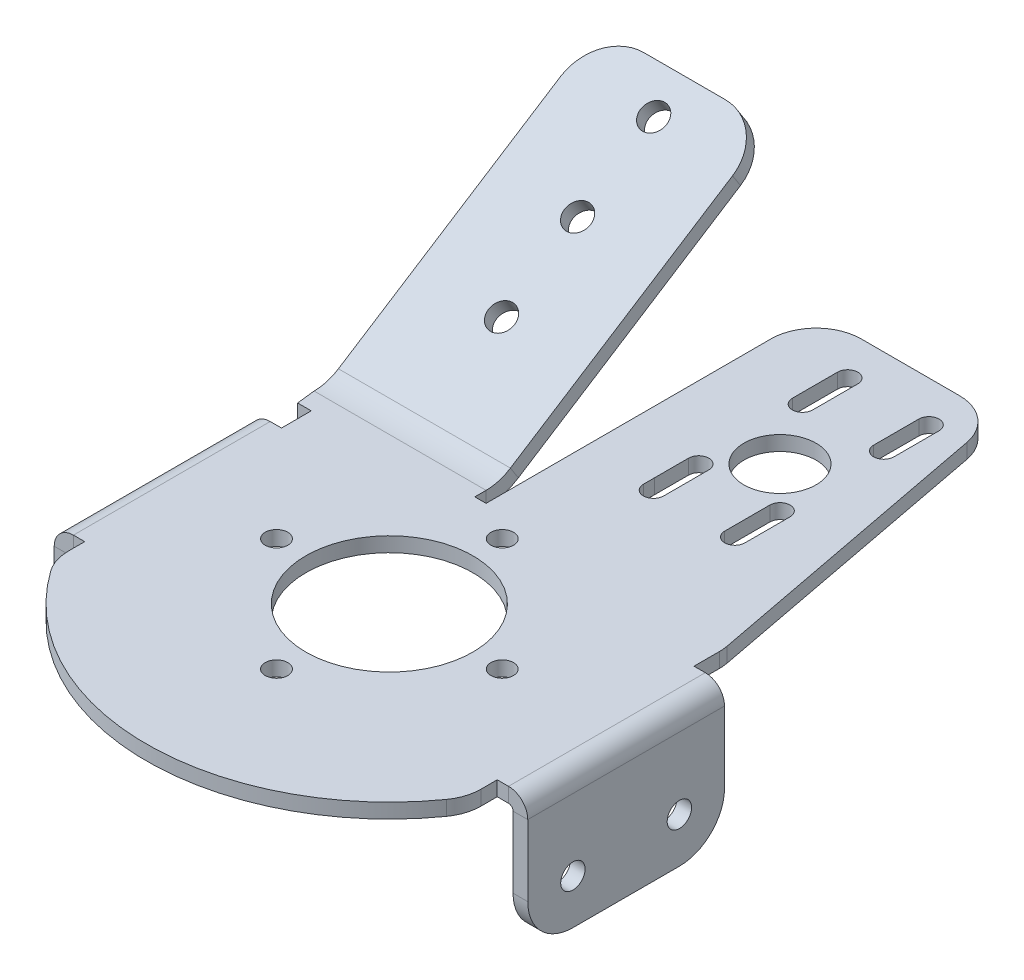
ISO-10303-21;
HEADER;
FILE_DESCRIPTION(('STEP AP214'),'2;1');
FILE_NAME('part.step','',(''),(''),'','','');
FILE_SCHEMA(('AUTOMOTIVE_DESIGN { 1 0 10303 214 1 1 1 1 }'));
ENDSEC;
DATA;
#1=APPLICATION_CONTEXT('core data for automotive mechanical design processes');
#2=APPLICATION_PROTOCOL_DEFINITION('international standard','automotive_design',2000,#1);
#3=PRODUCT_CONTEXT('',#1,'mechanical');
#4=PRODUCT('Part','Part','',(#3));
#5=PRODUCT_RELATED_PRODUCT_CATEGORY('part','',(#4));
#6=PRODUCT_DEFINITION_FORMATION('','',#4);
#7=PRODUCT_DEFINITION_CONTEXT('part definition',#1,'design');
#8=PRODUCT_DEFINITION('design','',#6,#7);
#9=PRODUCT_DEFINITION_SHAPE('','',#8);
#10=(LENGTH_UNIT() NAMED_UNIT(*) SI_UNIT(.MILLI.,.METRE.));
#11=(NAMED_UNIT(*) PLANE_ANGLE_UNIT() SI_UNIT($,.RADIAN.));
#12=(NAMED_UNIT(*) SI_UNIT($,.STERADIAN.) SOLID_ANGLE_UNIT());
#13=UNCERTAINTY_MEASURE_WITH_UNIT(LENGTH_MEASURE(1.E-05),#10,'distance_accuracy_value','');
#14=(GEOMETRIC_REPRESENTATION_CONTEXT(3) GLOBAL_UNCERTAINTY_ASSIGNED_CONTEXT((#13)) GLOBAL_UNIT_ASSIGNED_CONTEXT((#10,
#11,#12)) REPRESENTATION_CONTEXT('',''));
#15=CARTESIAN_POINT('',(0.,0.,0.));
#16=DIRECTION('',(0.,0.,1.));
#17=DIRECTION('',(1.,0.,0.));
#18=AXIS2_PLACEMENT_3D('',#15,#16,#17);
#19=CARTESIAN_POINT('',(98.35,0.,0.));
#20=DIRECTION('',(0.,1.,0.));
#21=DIRECTION('',(0.,0.,1.));
#22=AXIS2_PLACEMENT_3D('',#19,#20,#21);
#23=PLANE('',#22);
#24=CARTESIAN_POINT('',(98.35,0.,25.));
#25=DIRECTION('',(0.,-1.,0.));
#26=DIRECTION('',(0.,0.,1.));
#27=AXIS2_PLACEMENT_3D('',#24,#25,#26);
#28=CIRCLE('',#27,2.5);
#29=CARTESIAN_POINT('',(98.35,0.,27.5));
#30=VERTEX_POINT('',#29);
#31=EDGE_CURVE('E1237',#30,#30,#28,.T.);
#32=ORIENTED_EDGE('',*,*,#31,.F.);
#33=EDGE_LOOP('',(#32));
#34=FACE_BOUND('',#33,.T.);
#35=CARTESIAN_POINT('',(73.35,0.,0.));
#36=DIRECTION('',(0.,-1.,0.));
#37=DIRECTION('',(0.,0.,1.));
#38=AXIS2_PLACEMENT_3D('',#35,#36,#37);
#39=CIRCLE('',#38,2.5);
#40=CARTESIAN_POINT('',(73.35,0.,2.5));
#41=VERTEX_POINT('',#40);
#42=EDGE_CURVE('E2395',#41,#41,#39,.T.);
#43=ORIENTED_EDGE('',*,*,#42,.F.);
#44=EDGE_LOOP('',(#43));
#45=FACE_BOUND('',#44,.T.);
#46=CARTESIAN_POINT('',(98.35,0.,-25.));
#47=DIRECTION('',(0.,-1.,0.));
#48=DIRECTION('',(0.,0.,1.));
#49=AXIS2_PLACEMENT_3D('',#46,#47,#48);
#50=CIRCLE('',#49,2.5);
#51=CARTESIAN_POINT('',(98.35,0.,-22.5));
#52=VERTEX_POINT('',#51);
#53=EDGE_CURVE('E2398',#52,#52,#50,.T.);
#54=ORIENTED_EDGE('',*,*,#53,.F.);
#55=EDGE_LOOP('',(#54));
#56=FACE_BOUND('',#55,.T.);
#57=CARTESIAN_POINT('',(123.35,0.,0.));
#58=DIRECTION('',(0.,-1.,0.));
#59=DIRECTION('',(0.,0.,1.));
#60=AXIS2_PLACEMENT_3D('',#57,#58,#59);
#61=CIRCLE('',#60,2.5);
#62=CARTESIAN_POINT('',(123.35,0.,2.5));
#63=VERTEX_POINT('',#62);
#64=EDGE_CURVE('E2403',#63,#63,#61,.T.);
#65=ORIENTED_EDGE('',*,*,#64,.F.);
#66=EDGE_LOOP('',(#65));
#67=FACE_BOUND('',#66,.T.);
#68=DIRECTION('',(0.,0.,-1.));
#69=VECTOR('',#68,1.);
#70=CARTESIAN_POINT('',(144.04,0.,0.));
#71=LINE('',#70,#69);
#72=CARTESIAN_POINT('',(144.04,0.,-21.79449472));
#73=VERTEX_POINT('',#72);
#74=CARTESIAN_POINT('',(144.04,0.,-27.4403309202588));
#75=VERTEX_POINT('',#74);
#76=EDGE_CURVE('E968',#73,#75,#71,.T.);
#77=ORIENTED_EDGE('',*,*,#76,.F.);
#78=DIRECTION('',(-1.,0.,0.));
#79=VECTOR('',#78,1.);
#80=CARTESIAN_POINT('',(98.35,0.,-21.79449472));
#81=LINE('',#80,#79);
#82=CARTESIAN_POINT('',(146.54,0.,-21.79449472));
#83=VERTEX_POINT('',#82);
#84=EDGE_CURVE('E964',#83,#73,#81,.T.);
#85=ORIENTED_EDGE('',*,*,#84,.F.);
#86=DIRECTION('',(0.,0.,1.));
#87=VECTOR('',#86,1.);
#88=CARTESIAN_POINT('',(146.54,0.,0.));
#89=LINE('',#88,#87);
#90=CARTESIAN_POINT('',(146.54,0.,21.79449472));
#91=VERTEX_POINT('',#90);
#92=EDGE_CURVE('E960',#83,#91,#89,.T.);
#93=ORIENTED_EDGE('',*,*,#92,.T.);
#94=DIRECTION('',(-1.,0.,0.));
#95=VECTOR('',#94,1.);
#96=CARTESIAN_POINT('',(98.35,0.,21.79449472));
#97=LINE('',#96,#95);
#98=CARTESIAN_POINT('',(144.04,0.,21.79449472));
#99=VERTEX_POINT('',#98);
#100=EDGE_CURVE('E956',#91,#99,#97,.T.);
#101=ORIENTED_EDGE('',*,*,#100,.T.);
#102=DIRECTION('',(0.,0.,1.));
#103=VECTOR('',#102,1.);
#104=CARTESIAN_POINT('',(144.04,0.,0.));
#105=LINE('',#104,#103);
#106=CARTESIAN_POINT('',(144.04,0.,25.3729777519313));
#107=VERTEX_POINT('',#106);
#108=EDGE_CURVE('E919',#99,#107,#105,.T.);
#109=ORIENTED_EDGE('',*,*,#108,.T.);
#110=CARTESIAN_POINT('',(134.04,0.,25.3729777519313));
#111=DIRECTION('',(0.,-1.,0.));
#112=DIRECTION('',(0.,0.,1.));
#113=AXIS2_PLACEMENT_3D('',#110,#111,#112);
#114=CIRCLE('',#113,10.);
#115=CARTESIAN_POINT('',(142.190262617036,0.,31.1672179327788));
#116=VERTEX_POINT('',#115);
#117=EDGE_CURVE('E1087',#116,#107,#114,.F.);
#118=ORIENTED_EDGE('',*,*,#117,.F.);
#119=CARTESIAN_POINT('',(98.35,0.,0.));
#120=DIRECTION('',(0.,-1.,0.));
#121=DIRECTION('',(0.,0.,1.));
#122=AXIS2_PLACEMENT_3D('',#119,#120,#121);
#123=CIRCLE('',#122,53.79);
#124=CARTESIAN_POINT('',(54.5097373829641,0.,31.1672179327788));
#125=VERTEX_POINT('',#124);
#126=EDGE_CURVE('E915',#116,#125,#123,.T.);
#127=ORIENTED_EDGE('',*,*,#126,.T.);
#128=CARTESIAN_POINT('',(62.66,0.,25.3729777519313));
#129=DIRECTION('',(0.,-1.,0.));
#130=DIRECTION('',(0.,0.,1.));
#131=AXIS2_PLACEMENT_3D('',#128,#129,#130);
#132=CIRCLE('',#131,10.);
#133=CARTESIAN_POINT('',(52.66,0.,25.3729777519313));
#134=VERTEX_POINT('',#133);
#135=EDGE_CURVE('E1083',#134,#125,#132,.F.);
#136=ORIENTED_EDGE('',*,*,#135,.F.);
#137=DIRECTION('',(0.,0.,1.));
#138=VECTOR('',#137,1.);
#139=CARTESIAN_POINT('',(52.66,0.,0.));
#140=LINE('',#139,#138);
#141=CARTESIAN_POINT('',(52.66,0.,21.79449472));
#142=VERTEX_POINT('',#141);
#143=EDGE_CURVE('E920',#142,#134,#140,.T.);
#144=ORIENTED_EDGE('',*,*,#143,.F.);
#145=DIRECTION('',(1.,0.,0.));
#146=VECTOR('',#145,1.);
#147=CARTESIAN_POINT('',(98.35,0.,21.79449472));
#148=LINE('',#147,#146);
#149=CARTESIAN_POINT('',(50.16,0.,21.79449472));
#150=VERTEX_POINT('',#149);
#151=EDGE_CURVE('E946',#150,#142,#148,.T.);
#152=ORIENTED_EDGE('',*,*,#151,.F.);
#153=DIRECTION('',(0.,0.,1.));
#154=VECTOR('',#153,1.);
#155=CARTESIAN_POINT('',(50.16,0.,0.));
#156=LINE('',#155,#154);
#157=CARTESIAN_POINT('',(50.16,0.,-21.79449472));
#158=VERTEX_POINT('',#157);
#159=EDGE_CURVE('E942',#158,#150,#156,.T.);
#160=ORIENTED_EDGE('',*,*,#159,.F.);
#161=DIRECTION('',(1.,0.,0.));
#162=VECTOR('',#161,1.);
#163=CARTESIAN_POINT('',(98.35,0.,-21.79449472));
#164=LINE('',#163,#162);
#165=CARTESIAN_POINT('',(52.66,0.,-21.79449472));
#166=VERTEX_POINT('',#165);
#167=EDGE_CURVE('E938',#158,#166,#164,.T.);
#168=ORIENTED_EDGE('',*,*,#167,.T.);
#169=DIRECTION('',(0.,0.,-1.));
#170=VECTOR('',#169,1.);
#171=CARTESIAN_POINT('',(52.66,0.,0.));
#172=LINE('',#171,#170);
#173=CARTESIAN_POINT('',(52.66,0.,-28.3864051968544));
#174=VERTEX_POINT('',#173);
#175=EDGE_CURVE('E934',#166,#174,#172,.T.);
#176=ORIENTED_EDGE('',*,*,#175,.T.);
#177=DIRECTION('',(-1.,0.,0.));
#178=VECTOR('',#177,1.);
#179=CARTESIAN_POINT('',(98.3499999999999,0.,-28.3864051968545));
#180=LINE('',#179,#178);
#181=CARTESIAN_POINT('',(49.6460103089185,0.,-28.3864051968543));
#182=VERTEX_POINT('',#181);
#183=EDGE_CURVE('E930',#174,#182,#180,.T.);
#184=ORIENTED_EDGE('',*,*,#183,.T.);
#185=DIRECTION('',(0.113757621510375,0.,0.993508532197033));
#186=VECTOR('',#185,1.);
#187=CARTESIAN_POINT('',(53.4844866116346,0.,5.137141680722));
#188=LINE('',#187,#186);
#189=CARTESIAN_POINT('',(49.175,0.,-32.5));
#190=VERTEX_POINT('',#189);
#191=EDGE_CURVE('E925',#190,#182,#188,.T.);
#192=ORIENTED_EDGE('',*,*,#191,.F.);
#193=DIRECTION('',(-1.,0.,0.));
#194=VECTOR('',#193,1.);
#195=CARTESIAN_POINT('',(98.35,0.,-32.5));
#196=LINE('',#195,#194);
#197=CARTESIAN_POINT('',(87.275,0.,-32.5));
#198=VERTEX_POINT('',#197);
#199=EDGE_CURVE('E921',#198,#190,#196,.T.);
#200=ORIENTED_EDGE('',*,*,#199,.F.);
#201=DIRECTION('',(0.,0.,1.));
#202=VECTOR('',#201,1.);
#203=CARTESIAN_POINT('',(87.2749999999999,0.,0.));
#204=LINE('',#203,#202);
#205=CARTESIAN_POINT('',(87.275,0.,-30.));
#206=VERTEX_POINT('',#205);
#207=EDGE_CURVE('E802',#198,#206,#204,.T.);
#208=ORIENTED_EDGE('',*,*,#207,.T.);
#209=DIRECTION('',(1.,0.,0.));
#210=VECTOR('',#209,1.);
#211=CARTESIAN_POINT('',(98.3500000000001,0.,-30.));
#212=LINE('',#211,#210);
#213=CARTESIAN_POINT('',(89.775,0.,-30.));
#214=VERTEX_POINT('',#213);
#215=EDGE_CURVE('E796',#206,#214,#212,.T.);
#216=ORIENTED_EDGE('',*,*,#215,.T.);
#217=DIRECTION('',(0.,0.,-1.));
#218=VECTOR('',#217,1.);
#219=CARTESIAN_POINT('',(89.775,0.,0.));
#220=LINE('',#219,#218);
#221=CARTESIAN_POINT('',(89.775,0.,-93.1021042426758));
#222=VERTEX_POINT('',#221);
#223=EDGE_CURVE('E806',#214,#222,#220,.T.);
#224=ORIENTED_EDGE('',*,*,#223,.T.);
#225=CARTESIAN_POINT('',(99.775,0.,-93.1021042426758));
#226=DIRECTION('',(0.,-1.,0.));
#227=DIRECTION('',(0.,0.,1.));
#228=AXIS2_PLACEMENT_3D('',#225,#226,#227);
#229=CIRCLE('',#228,10.);
#230=CARTESIAN_POINT('',(99.775,0.,-103.102104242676));
#231=VERTEX_POINT('',#230);
#232=EDGE_CURVE('E1079',#231,#222,#229,.F.);
#233=ORIENTED_EDGE('',*,*,#232,.F.);
#234=DIRECTION('',(1.,0.,0.));
#235=VECTOR('',#234,1.);
#236=CARTESIAN_POINT('',(98.35,0.,-103.102104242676));
#237=LINE('',#236,#235);
#238=CARTESIAN_POINT('',(121.503609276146,0.,-103.102104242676));
#239=VERTEX_POINT('',#238);
#240=EDGE_CURVE('E593',#231,#239,#237,.T.);
#241=ORIENTED_EDGE('',*,*,#240,.T.);
#242=CARTESIAN_POINT('',(121.503609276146,0.,-93.1021042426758));
#243=DIRECTION('',(0.,-1.,0.));
#244=DIRECTION('',(0.,0.,1.));
#245=AXIS2_PLACEMENT_3D('',#242,#243,#244);
#246=CIRCLE('',#245,10.);
#247=CARTESIAN_POINT('',(131.326186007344,0.,-94.9774672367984));
#248=VERTEX_POINT('',#247);
#249=EDGE_CURVE('E1075',#248,#239,#246,.F.);
#250=ORIENTED_EDGE('',*,*,#249,.F.);
#251=DIRECTION('',(0.187536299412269,0.,0.982257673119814));
#252=VECTOR('',#251,1.);
#253=CARTESIAN_POINT('',(147.662119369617,0.,-9.41485379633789));
#254=LINE('',#253,#252);
#255=CARTESIAN_POINT('',(143.862576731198,0.,-29.3156939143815));
#256=VERTEX_POINT('',#255);
#257=EDGE_CURVE('E597',#248,#256,#254,.T.);
#258=ORIENTED_EDGE('',*,*,#257,.T.);
#259=CARTESIAN_POINT('',(134.04,0.,-27.4403309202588));
#260=DIRECTION('',(0.,-1.,0.));
#261=DIRECTION('',(0.,0.,1.));
#262=AXIS2_PLACEMENT_3D('',#259,#260,#261);
#263=CIRCLE('',#262,10.);
#264=EDGE_CURVE('E1091',#75,#256,#263,.F.);
#265=ORIENTED_EDGE('',*,*,#264,.F.);
#266=EDGE_LOOP('',(#77,#85,#93,#101,#109,#118,#127,#136,#144,#152,#160,#168,#176,#184,#192,#200,
#208,#216,#224,#233,#241,#250,#258,#265));
#267=FACE_BOUND('',#266,.T.);
#268=CARTESIAN_POINT('',(98.35,0.,0.));
#269=DIRECTION('',(0.,-1.,0.));
#270=DIRECTION('',(0.,0.,1.));
#271=AXIS2_PLACEMENT_3D('',#268,#269,#270);
#272=CIRCLE('',#271,18.5);
#273=CARTESIAN_POINT('',(98.35,0.,18.5));
#274=VERTEX_POINT('',#273);
#275=EDGE_CURVE('E728',#274,#274,#272,.T.);
#276=ORIENTED_EDGE('',*,*,#275,.F.);
#277=EDGE_LOOP('',(#276));
#278=FACE_BOUND('',#277,.T.);
#279=DIRECTION('',(0.,0.,1.));
#280=VECTOR('',#279,1.);
#281=CARTESIAN_POINT('',(108.025,0.,0.));
#282=LINE('',#281,#280);
#283=CARTESIAN_POINT('',(108.025,0.,-61.1014933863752));
#284=VERTEX_POINT('',#283);
#285=CARTESIAN_POINT('',(108.025,0.,-52.9127439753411));
#286=VERTEX_POINT('',#285);
#287=EDGE_CURVE('E601',#284,#286,#282,.T.);
#288=ORIENTED_EDGE('',*,*,#287,.F.);
#289=CARTESIAN_POINT('',(105.775,0.,-61.1014933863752));
#290=DIRECTION('',(0.,-1.,0.));
#291=DIRECTION('',(0.,0.,1.));
#292=AXIS2_PLACEMENT_3D('',#289,#290,#291);
#293=CIRCLE('',#292,2.25);
#294=CARTESIAN_POINT('',(103.525,0.,-61.1014933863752));
#295=VERTEX_POINT('',#294);
#296=EDGE_CURVE('E585',#295,#284,#293,.T.);
#297=ORIENTED_EDGE('',*,*,#296,.F.);
#298=DIRECTION('',(0.,0.,1.));
#299=VECTOR('',#298,1.);
#300=CARTESIAN_POINT('',(103.525,0.,0.));
#301=LINE('',#300,#299);
#302=CARTESIAN_POINT('',(103.525,0.,-53.5404844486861));
#303=VERTEX_POINT('',#302);
#304=EDGE_CURVE('E589',#295,#303,#301,.T.);
#305=ORIENTED_EDGE('',*,*,#304,.T.);
#306=DIRECTION('',(0.,0.,1.));
#307=VECTOR('',#306,1.);
#308=CARTESIAN_POINT('',(103.525,0.,0.));
#309=LINE('',#308,#307);
#310=CARTESIAN_POINT('',(103.525,0.,-51.1014933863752));
#311=VERTEX_POINT('',#310);
#312=EDGE_CURVE('E501',#303,#311,#309,.T.);
#313=ORIENTED_EDGE('',*,*,#312,.T.);
#314=CARTESIAN_POINT('',(105.775,0.,-51.1014933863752));
#315=DIRECTION('',(0.,-1.,0.));
#316=DIRECTION('',(0.,0.,1.));
#317=AXIS2_PLACEMENT_3D('',#314,#315,#316);
#318=CIRCLE('',#317,2.25);
#319=CARTESIAN_POINT('',(108.025,0.,-51.1014933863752));
#320=VERTEX_POINT('',#319);
#321=EDGE_CURVE('E496',#320,#311,#318,.T.);
#322=ORIENTED_EDGE('',*,*,#321,.F.);
#323=DIRECTION('',(0.,0.,1.));
#324=VECTOR('',#323,1.);
#325=CARTESIAN_POINT('',(108.025,0.,0.));
#326=LINE('',#325,#324);
#327=EDGE_CURVE('E529',#286,#320,#326,.T.);
#328=ORIENTED_EDGE('',*,*,#327,.F.);
#329=EDGE_LOOP('',(#288,#297,#305,#313,#322,#328));
#330=FACE_BOUND('',#329,.T.);
#331=CARTESIAN_POINT('',(105.775,0.,-84.1014933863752));
#332=DIRECTION('',(0.,-1.,0.));
#333=DIRECTION('',(0.,0.,1.));
#334=AXIS2_PLACEMENT_3D('',#331,#332,#333);
#335=CIRCLE('',#334,2.25);
#336=CARTESIAN_POINT('',(108.025,0.,-84.1014933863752));
#337=VERTEX_POINT('',#336);
#338=CARTESIAN_POINT('',(103.525,0.,-84.1014933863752));
#339=VERTEX_POINT('',#338);
#340=EDGE_CURVE('E536',#337,#339,#335,.T.);
#341=ORIENTED_EDGE('',*,*,#340,.F.);
#342=DIRECTION('',(0.,0.,1.));
#343=VECTOR('',#342,1.);
#344=CARTESIAN_POINT('',(108.025,0.,0.));
#345=LINE('',#344,#343);
#346=CARTESIAN_POINT('',(108.025,0.,-94.1014933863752));
#347=VERTEX_POINT('',#346);
#348=EDGE_CURVE('E540',#347,#337,#345,.T.);
#349=ORIENTED_EDGE('',*,*,#348,.F.);
#350=CARTESIAN_POINT('',(105.775,0.,-94.1014933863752));
#351=DIRECTION('',(0.,-1.,0.));
#352=DIRECTION('',(0.,0.,1.));
#353=AXIS2_PLACEMENT_3D('',#350,#351,#352);
#354=CIRCLE('',#353,2.25);
#355=CARTESIAN_POINT('',(103.525,0.,-94.1014933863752));
#356=VERTEX_POINT('',#355);
#357=EDGE_CURVE('E545',#356,#347,#354,.T.);
#358=ORIENTED_EDGE('',*,*,#357,.F.);
#359=DIRECTION('',(0.,0.,1.));
#360=VECTOR('',#359,1.);
#361=CARTESIAN_POINT('',(103.525,0.,0.));
#362=LINE('',#361,#360);
#363=EDGE_CURVE('E549',#356,#339,#362,.T.);
#364=ORIENTED_EDGE('',*,*,#363,.T.);
#365=EDGE_LOOP('',(#341,#349,#358,#364));
#366=FACE_BOUND('',#365,.T.);
#367=CARTESIAN_POINT('',(123.775,0.,-84.101493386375));
#368=DIRECTION('',(0.,-1.,0.));
#369=DIRECTION('',(0.,0.,1.));
#370=AXIS2_PLACEMENT_3D('',#367,#368,#369);
#371=CIRCLE('',#370,2.25);
#372=CARTESIAN_POINT('',(126.025,0.,-84.101493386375));
#373=VERTEX_POINT('',#372);
#374=CARTESIAN_POINT('',(121.525,0.,-84.101493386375));
#375=VERTEX_POINT('',#374);
#376=EDGE_CURVE('E553',#373,#375,#371,.T.);
#377=ORIENTED_EDGE('',*,*,#376,.F.);
#378=DIRECTION('',(0.,0.,1.));
#379=VECTOR('',#378,1.);
#380=CARTESIAN_POINT('',(126.025,0.,0.));
#381=LINE('',#380,#379);
#382=CARTESIAN_POINT('',(126.025,0.,-94.101493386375));
#383=VERTEX_POINT('',#382);
#384=EDGE_CURVE('E557',#383,#373,#381,.T.);
#385=ORIENTED_EDGE('',*,*,#384,.F.);
#386=CARTESIAN_POINT('',(123.775,0.,-94.101493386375));
#387=DIRECTION('',(0.,-1.,0.));
#388=DIRECTION('',(0.,0.,1.));
#389=AXIS2_PLACEMENT_3D('',#386,#387,#388);
#390=CIRCLE('',#389,2.25);
#391=CARTESIAN_POINT('',(121.525,0.,-94.101493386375));
#392=VERTEX_POINT('',#391);
#393=EDGE_CURVE('E561',#392,#383,#390,.T.);
#394=ORIENTED_EDGE('',*,*,#393,.F.);
#395=DIRECTION('',(0.,0.,1.));
#396=VECTOR('',#395,1.);
#397=CARTESIAN_POINT('',(121.525,0.,0.));
#398=LINE('',#397,#396);
#399=EDGE_CURVE('E565',#392,#375,#398,.T.);
#400=ORIENTED_EDGE('',*,*,#399,.T.);
#401=EDGE_LOOP('',(#377,#385,#394,#400));
#402=FACE_BOUND('',#401,.T.);
#403=CARTESIAN_POINT('',(123.775,0.,-51.101493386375));
#404=DIRECTION('',(0.,-1.,0.));
#405=DIRECTION('',(0.,0.,1.));
#406=AXIS2_PLACEMENT_3D('',#403,#404,#405);
#407=CIRCLE('',#406,2.25);
#408=CARTESIAN_POINT('',(126.025,0.,-51.101493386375));
#409=VERTEX_POINT('',#408);
#410=CARTESIAN_POINT('',(121.525,0.,-51.101493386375));
#411=VERTEX_POINT('',#410);
#412=EDGE_CURVE('E569',#409,#411,#407,.T.);
#413=ORIENTED_EDGE('',*,*,#412,.F.);
#414=DIRECTION('',(0.,0.,1.));
#415=VECTOR('',#414,1.);
#416=CARTESIAN_POINT('',(126.025,0.,0.));
#417=LINE('',#416,#415);
#418=CARTESIAN_POINT('',(126.025,0.,-61.101493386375));
#419=VERTEX_POINT('',#418);
#420=EDGE_CURVE('E573',#419,#409,#417,.T.);
#421=ORIENTED_EDGE('',*,*,#420,.F.);
#422=CARTESIAN_POINT('',(123.775,0.,-61.101493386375));
#423=DIRECTION('',(0.,-1.,0.));
#424=DIRECTION('',(0.,0.,1.));
#425=AXIS2_PLACEMENT_3D('',#422,#423,#424);
#426=CIRCLE('',#425,2.25);
#427=CARTESIAN_POINT('',(121.525,0.,-61.101493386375));
#428=VERTEX_POINT('',#427);
#429=EDGE_CURVE('E577',#428,#419,#426,.T.);
#430=ORIENTED_EDGE('',*,*,#429,.F.);
#431=DIRECTION('',(0.,0.,1.));
#432=VECTOR('',#431,1.);
#433=CARTESIAN_POINT('',(121.525,0.,0.));
#434=LINE('',#433,#432);
#435=EDGE_CURVE('E581',#428,#411,#434,.T.);
#436=ORIENTED_EDGE('',*,*,#435,.T.);
#437=EDGE_LOOP('',(#413,#421,#430,#436));
#438=FACE_BOUND('',#437,.T.);
#439=CARTESIAN_POINT('',(114.775,0.,-70.1014933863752));
#440=DIRECTION('',(0.,-1.,0.));
#441=DIRECTION('',(0.,0.,1.));
#442=AXIS2_PLACEMENT_3D('',#439,#440,#441);
#443=CIRCLE('',#442,7.99999999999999);
#444=CARTESIAN_POINT('',(114.775,0.,-62.1014933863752));
#445=VERTEX_POINT('',#444);
#446=EDGE_CURVE('E605',#445,#445,#443,.T.);
#447=ORIENTED_EDGE('',*,*,#446,.F.);
#448=EDGE_LOOP('',(#447));
#449=FACE_BOUND('',#448,.T.);
#450=ADVANCED_FACE('F109',(#34,#45,#56,#67,#267,#278,#330,#366,#402,#438,#449),#23,.F.);
#451=CARTESIAN_POINT('',(98.35,3.26,0.));
#452=DIRECTION('',(0.,1.,0.));
#453=DIRECTION('',(0.,0.,1.));
#454=AXIS2_PLACEMENT_3D('',#451,#452,#453);
#455=PLANE('',#454);
#456=CARTESIAN_POINT('',(98.35,3.26,25.));
#457=DIRECTION('',(0.,-1.,0.));
#458=DIRECTION('',(0.,0.,1.));
#459=AXIS2_PLACEMENT_3D('',#456,#457,#458);
#460=CIRCLE('',#459,2.5);
#461=CARTESIAN_POINT('',(98.35,3.26,27.5));
#462=VERTEX_POINT('',#461);
#463=EDGE_CURVE('E2392',#462,#462,#460,.T.);
#464=ORIENTED_EDGE('',*,*,#463,.T.);
#465=EDGE_LOOP('',(#464));
#466=FACE_BOUND('',#465,.T.);
#467=CARTESIAN_POINT('',(73.35,3.26,0.));
#468=DIRECTION('',(0.,-1.,0.));
#469=DIRECTION('',(0.,0.,1.));
#470=AXIS2_PLACEMENT_3D('',#467,#468,#469);
#471=CIRCLE('',#470,2.5);
#472=CARTESIAN_POINT('',(73.35,3.26,2.5));
#473=VERTEX_POINT('',#472);
#474=EDGE_CURVE('E2417',#473,#473,#471,.T.);
#475=ORIENTED_EDGE('',*,*,#474,.T.);
#476=EDGE_LOOP('',(#475));
#477=FACE_BOUND('',#476,.T.);
#478=CARTESIAN_POINT('',(98.35,3.26,-25.));
#479=DIRECTION('',(0.,-1.,0.));
#480=DIRECTION('',(0.,0.,1.));
#481=AXIS2_PLACEMENT_3D('',#478,#479,#480);
#482=CIRCLE('',#481,2.5);
#483=CARTESIAN_POINT('',(98.35,3.26,-22.5));
#484=VERTEX_POINT('',#483);
#485=EDGE_CURVE('E2413',#484,#484,#482,.T.);
#486=ORIENTED_EDGE('',*,*,#485,.T.);
#487=EDGE_LOOP('',(#486));
#488=FACE_BOUND('',#487,.T.);
#489=CARTESIAN_POINT('',(123.35,3.26,0.));
#490=DIRECTION('',(0.,-1.,0.));
#491=DIRECTION('',(0.,0.,1.));
#492=AXIS2_PLACEMENT_3D('',#489,#490,#491);
#493=CIRCLE('',#492,2.5);
#494=CARTESIAN_POINT('',(123.35,3.26,2.5));
#495=VERTEX_POINT('',#494);
#496=EDGE_CURVE('E2409',#495,#495,#493,.T.);
#497=ORIENTED_EDGE('',*,*,#496,.T.);
#498=EDGE_LOOP('',(#497));
#499=FACE_BOUND('',#498,.T.);
#500=DIRECTION('',(0.,0.,1.));
#501=VECTOR('',#500,1.);
#502=CARTESIAN_POINT('',(108.025,3.26,-61.1014933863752));
#503=LINE('',#502,#501);
#504=CARTESIAN_POINT('',(108.025,3.26,-52.9127439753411));
#505=VERTEX_POINT('',#504);
#506=CARTESIAN_POINT('',(108.025,3.26,-51.1014933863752));
#507=VERTEX_POINT('',#506);
#508=EDGE_CURVE('E517',#505,#507,#503,.T.);
#509=ORIENTED_EDGE('',*,*,#508,.T.);
#510=CARTESIAN_POINT('',(105.775,3.26,-51.1014933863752));
#511=DIRECTION('',(0.,-1.,0.));
#512=DIRECTION('',(0.,0.,1.));
#513=AXIS2_PLACEMENT_3D('',#510,#511,#512);
#514=CIRCLE('',#513,2.25);
#515=CARTESIAN_POINT('',(103.525,3.26,-51.1014933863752));
#516=VERTEX_POINT('',#515);
#517=EDGE_CURVE('E493',#507,#516,#514,.T.);
#518=ORIENTED_EDGE('',*,*,#517,.T.);
#519=DIRECTION('',(0.,0.,1.));
#520=VECTOR('',#519,1.);
#521=CARTESIAN_POINT('',(103.525,3.26,-61.1014933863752));
#522=LINE('',#521,#520);
#523=CARTESIAN_POINT('',(103.525,3.26,-53.5404844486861));
#524=VERTEX_POINT('',#523);
#525=EDGE_CURVE('E505',#524,#516,#522,.T.);
#526=ORIENTED_EDGE('',*,*,#525,.F.);
#527=DIRECTION('',(0.,0.,1.));
#528=VECTOR('',#527,1.);
#529=CARTESIAN_POINT('',(103.525,3.26,0.));
#530=LINE('',#529,#528);
#531=CARTESIAN_POINT('',(103.525,3.26,-61.1014933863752));
#532=VERTEX_POINT('',#531);
#533=EDGE_CURVE('E661',#532,#524,#530,.T.);
#534=ORIENTED_EDGE('',*,*,#533,.F.);
#535=CARTESIAN_POINT('',(105.775,3.26,-61.1014933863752));
#536=DIRECTION('',(0.,-1.,0.));
#537=DIRECTION('',(0.,0.,1.));
#538=AXIS2_PLACEMENT_3D('',#535,#536,#537);
#539=CIRCLE('',#538,2.25);
#540=CARTESIAN_POINT('',(108.025,3.26,-61.1014933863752));
#541=VERTEX_POINT('',#540);
#542=EDGE_CURVE('E657',#532,#541,#539,.T.);
#543=ORIENTED_EDGE('',*,*,#542,.T.);
#544=DIRECTION('',(0.,0.,1.));
#545=VECTOR('',#544,1.);
#546=CARTESIAN_POINT('',(108.025,3.26,0.));
#547=LINE('',#546,#545);
#548=EDGE_CURVE('E672',#541,#505,#547,.T.);
#549=ORIENTED_EDGE('',*,*,#548,.T.);
#550=EDGE_LOOP('',(#509,#518,#526,#534,#543,#549));
#551=FACE_BOUND('',#550,.T.);
#552=DIRECTION('',(0.187536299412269,0.,0.982257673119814));
#553=VECTOR('',#552,1.);
#554=CARTESIAN_POINT('',(147.662119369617,3.26,-9.41485379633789));
#555=LINE('',#554,#553);
#556=CARTESIAN_POINT('',(131.326186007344,3.26,-94.9774672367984));
#557=VERTEX_POINT('',#556);
#558=CARTESIAN_POINT('',(143.862576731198,3.26,-29.3156939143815));
#559=VERTEX_POINT('',#558);
#560=EDGE_CURVE('E668',#557,#559,#555,.T.);
#561=ORIENTED_EDGE('',*,*,#560,.F.);
#562=CARTESIAN_POINT('',(121.503609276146,3.26,-93.1021042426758));
#563=DIRECTION('',(0.,-1.,0.));
#564=DIRECTION('',(0.,0.,1.));
#565=AXIS2_PLACEMENT_3D('',#562,#563,#564);
#566=CIRCLE('',#565,10.);
#567=CARTESIAN_POINT('',(121.503609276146,3.26,-103.102104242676));
#568=VERTEX_POINT('',#567);
#569=EDGE_CURVE('E1101',#568,#557,#566,.T.);
#570=ORIENTED_EDGE('',*,*,#569,.F.);
#571=DIRECTION('',(1.,0.,0.));
#572=VECTOR('',#571,1.);
#573=CARTESIAN_POINT('',(98.35,3.26,-103.102104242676));
#574=LINE('',#573,#572);
#575=CARTESIAN_POINT('',(99.775,3.26,-103.102104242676));
#576=VERTEX_POINT('',#575);
#577=EDGE_CURVE('E664',#576,#568,#574,.T.);
#578=ORIENTED_EDGE('',*,*,#577,.F.);
#579=CARTESIAN_POINT('',(99.775,3.26,-93.1021042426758));
#580=DIRECTION('',(0.,-1.,0.));
#581=DIRECTION('',(0.,0.,1.));
#582=AXIS2_PLACEMENT_3D('',#579,#580,#581);
#583=CIRCLE('',#582,10.);
#584=CARTESIAN_POINT('',(89.775,3.26,-93.1021042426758));
#585=VERTEX_POINT('',#584);
#586=EDGE_CURVE('E1105',#585,#576,#583,.T.);
#587=ORIENTED_EDGE('',*,*,#586,.F.);
#588=DIRECTION('',(0.,0.,-1.));
#589=VECTOR('',#588,1.);
#590=CARTESIAN_POINT('',(89.775,3.26,0.));
#591=LINE('',#590,#589);
#592=CARTESIAN_POINT('',(89.775,3.26,-30.));
#593=VERTEX_POINT('',#592);
#594=EDGE_CURVE('E775',#593,#585,#591,.T.);
#595=ORIENTED_EDGE('',*,*,#594,.F.);
#596=DIRECTION('',(1.,0.,0.));
#597=VECTOR('',#596,1.);
#598=CARTESIAN_POINT('',(98.3500000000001,3.26,-30.));
#599=LINE('',#598,#597);
#600=CARTESIAN_POINT('',(87.275,3.26,-30.));
#601=VERTEX_POINT('',#600);
#602=EDGE_CURVE('E788',#601,#593,#599,.T.);
#603=ORIENTED_EDGE('',*,*,#602,.F.);
#604=DIRECTION('',(0.,0.,1.));
#605=VECTOR('',#604,1.);
#606=CARTESIAN_POINT('',(87.2749999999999,3.26,0.));
#607=LINE('',#606,#605);
#608=CARTESIAN_POINT('',(87.275,3.26,-32.5));
#609=VERTEX_POINT('',#608);
#610=EDGE_CURVE('E1068',#609,#601,#607,.T.);
#611=ORIENTED_EDGE('',*,*,#610,.F.);
#612=DIRECTION('',(-1.,0.,0.));
#613=VECTOR('',#612,1.);
#614=CARTESIAN_POINT('',(98.35,3.26,-32.5));
#615=LINE('',#614,#613);
#616=CARTESIAN_POINT('',(49.175,3.26,-32.5));
#617=VERTEX_POINT('',#616);
#618=EDGE_CURVE('E905',#609,#617,#615,.T.);
#619=ORIENTED_EDGE('',*,*,#618,.T.);
#620=DIRECTION('',(0.113757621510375,0.,0.993508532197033));
#621=VECTOR('',#620,1.);
#622=CARTESIAN_POINT('',(53.4844866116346,3.26,5.137141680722));
#623=LINE('',#622,#621);
#624=CARTESIAN_POINT('',(49.6460103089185,3.26,-28.3864051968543));
#625=VERTEX_POINT('',#624);
#626=EDGE_CURVE('E1020',#617,#625,#623,.T.);
#627=ORIENTED_EDGE('',*,*,#626,.T.);
#628=DIRECTION('',(-1.,0.,0.));
#629=VECTOR('',#628,1.);
#630=CARTESIAN_POINT('',(98.35,3.26,-28.3864051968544));
#631=LINE('',#630,#629);
#632=CARTESIAN_POINT('',(52.66,3.26,-28.3864051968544));
#633=VERTEX_POINT('',#632);
#634=EDGE_CURVE('E1016',#633,#625,#631,.T.);
#635=ORIENTED_EDGE('',*,*,#634,.F.);
#636=DIRECTION('',(0.,0.,1.));
#637=VECTOR('',#636,1.);
#638=CARTESIAN_POINT('',(52.66,3.26,0.));
#639=LINE('',#638,#637);
#640=CARTESIAN_POINT('',(52.66,3.26,-21.79449472));
#641=VERTEX_POINT('',#640);
#642=EDGE_CURVE('E1012',#641,#633,#639,.F.);
#643=ORIENTED_EDGE('',*,*,#642,.F.);
#644=DIRECTION('',(-1.,0.,0.));
#645=VECTOR('',#644,1.);
#646=CARTESIAN_POINT('',(98.35,3.26,-21.79449472));
#647=LINE('',#646,#645);
#648=CARTESIAN_POINT('',(50.16,3.26,-21.79449472));
#649=VERTEX_POINT('',#648);
#650=EDGE_CURVE('E1008',#649,#641,#647,.F.);
#651=ORIENTED_EDGE('',*,*,#650,.F.);
#652=DIRECTION('',(0.,0.,1.));
#653=VECTOR('',#652,1.);
#654=CARTESIAN_POINT('',(50.16,3.26,0.));
#655=LINE('',#654,#653);
#656=CARTESIAN_POINT('',(50.16,3.26,21.79449472));
#657=VERTEX_POINT('',#656);
#658=EDGE_CURVE('E1004',#649,#657,#655,.T.);
#659=ORIENTED_EDGE('',*,*,#658,.T.);
#660=DIRECTION('',(-1.,0.,0.));
#661=VECTOR('',#660,1.);
#662=CARTESIAN_POINT('',(98.35,3.26,21.79449472));
#663=LINE('',#662,#661);
#664=CARTESIAN_POINT('',(52.66,3.26,21.79449472));
#665=VERTEX_POINT('',#664);
#666=EDGE_CURVE('E1000',#657,#665,#663,.F.);
#667=ORIENTED_EDGE('',*,*,#666,.T.);
#668=DIRECTION('',(0.,0.,1.));
#669=VECTOR('',#668,1.);
#670=CARTESIAN_POINT('',(52.66,3.26,0.));
#671=LINE('',#670,#669);
#672=CARTESIAN_POINT('',(52.66,3.26,25.3729777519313));
#673=VERTEX_POINT('',#672);
#674=EDGE_CURVE('E996',#665,#673,#671,.T.);
#675=ORIENTED_EDGE('',*,*,#674,.T.);
#676=CARTESIAN_POINT('',(62.66,3.26,25.3729777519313));
#677=DIRECTION('',(0.,-1.,0.));
#678=DIRECTION('',(0.,0.,1.));
#679=AXIS2_PLACEMENT_3D('',#676,#677,#678);
#680=CIRCLE('',#679,10.);
#681=CARTESIAN_POINT('',(54.5097373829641,3.26,31.1672179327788));
#682=VERTEX_POINT('',#681);
#683=EDGE_CURVE('E1109',#682,#673,#680,.T.);
#684=ORIENTED_EDGE('',*,*,#683,.F.);
#685=CARTESIAN_POINT('',(98.35,3.26,0.));
#686=DIRECTION('',(0.,-1.,0.));
#687=DIRECTION('',(0.,0.,1.));
#688=AXIS2_PLACEMENT_3D('',#685,#686,#687);
#689=CIRCLE('',#688,53.79);
#690=CARTESIAN_POINT('',(142.190262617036,3.26,31.1672179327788));
#691=VERTEX_POINT('',#690);
#692=EDGE_CURVE('E992',#691,#682,#689,.T.);
#693=ORIENTED_EDGE('',*,*,#692,.F.);
#694=CARTESIAN_POINT('',(134.04,3.26,25.3729777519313));
#695=DIRECTION('',(0.,-1.,0.));
#696=DIRECTION('',(0.,0.,1.));
#697=AXIS2_PLACEMENT_3D('',#694,#695,#696);
#698=CIRCLE('',#697,10.);
#699=CARTESIAN_POINT('',(144.04,3.26,25.3729777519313));
#700=VERTEX_POINT('',#699);
#701=EDGE_CURVE('E1113',#700,#691,#698,.T.);
#702=ORIENTED_EDGE('',*,*,#701,.F.);
#703=DIRECTION('',(0.,0.,1.));
#704=VECTOR('',#703,1.);
#705=CARTESIAN_POINT('',(144.04,3.26,0.));
#706=LINE('',#705,#704);
#707=CARTESIAN_POINT('',(144.04,3.26,21.79449472));
#708=VERTEX_POINT('',#707);
#709=EDGE_CURVE('E988',#708,#700,#706,.T.);
#710=ORIENTED_EDGE('',*,*,#709,.F.);
#711=DIRECTION('',(-1.,0.,0.));
#712=VECTOR('',#711,1.);
#713=CARTESIAN_POINT('',(98.35,3.26,21.79449472));
#714=LINE('',#713,#712);
#715=CARTESIAN_POINT('',(146.54,3.26,21.79449472));
#716=VERTEX_POINT('',#715);
#717=EDGE_CURVE('E984',#716,#708,#714,.T.);
#718=ORIENTED_EDGE('',*,*,#717,.F.);
#719=DIRECTION('',(0.,0.,1.));
#720=VECTOR('',#719,1.);
#721=CARTESIAN_POINT('',(146.54,3.26,0.));
#722=LINE('',#721,#720);
#723=CARTESIAN_POINT('',(146.54,3.26,-21.79449472));
#724=VERTEX_POINT('',#723);
#725=EDGE_CURVE('E980',#724,#716,#722,.T.);
#726=ORIENTED_EDGE('',*,*,#725,.F.);
#727=DIRECTION('',(-1.,0.,0.));
#728=VECTOR('',#727,1.);
#729=CARTESIAN_POINT('',(98.35,3.26,-21.79449472));
#730=LINE('',#729,#728);
#731=CARTESIAN_POINT('',(144.04,3.26,-21.79449472));
#732=VERTEX_POINT('',#731);
#733=EDGE_CURVE('E976',#724,#732,#730,.T.);
#734=ORIENTED_EDGE('',*,*,#733,.T.);
#735=DIRECTION('',(0.,0.,1.));
#736=VECTOR('',#735,1.);
#737=CARTESIAN_POINT('',(144.04,3.26,0.));
#738=LINE('',#737,#736);
#739=CARTESIAN_POINT('',(144.04,3.26,-27.4403309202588));
#740=VERTEX_POINT('',#739);
#741=EDGE_CURVE('E926',#732,#740,#738,.F.);
#742=ORIENTED_EDGE('',*,*,#741,.T.);
#743=CARTESIAN_POINT('',(134.04,3.26,-27.4403309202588));
#744=DIRECTION('',(0.,-1.,0.));
#745=DIRECTION('',(0.,0.,1.));
#746=AXIS2_PLACEMENT_3D('',#743,#744,#745);
#747=CIRCLE('',#746,10.);
#748=EDGE_CURVE('E1117',#559,#740,#747,.T.);
#749=ORIENTED_EDGE('',*,*,#748,.F.);
#750=EDGE_LOOP('',(#561,#570,#578,#587,#595,#603,#611,#619,#627,#635,#643,#651,#659,#667,#675,
#684,#693,#702,#710,#718,#726,#734,#742,#749));
#751=FACE_BOUND('',#750,.T.);
#752=CARTESIAN_POINT('',(98.35,3.26,0.));
#753=DIRECTION('',(0.,-1.,0.));
#754=DIRECTION('',(0.,0.,1.));
#755=AXIS2_PLACEMENT_3D('',#752,#753,#754);
#756=CIRCLE('',#755,18.5);
#757=CARTESIAN_POINT('',(98.35,3.26,18.5));
#758=VERTEX_POINT('',#757);
#759=EDGE_CURVE('E681',#758,#758,#756,.T.);
#760=ORIENTED_EDGE('',*,*,#759,.T.);
#761=EDGE_LOOP('',(#760));
#762=FACE_BOUND('',#761,.T.);
#763=CARTESIAN_POINT('',(105.775,3.26,-84.1014933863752));
#764=DIRECTION('',(0.,-1.,0.));
#765=DIRECTION('',(0.,0.,1.));
#766=AXIS2_PLACEMENT_3D('',#763,#764,#765);
#767=CIRCLE('',#766,2.25);
#768=CARTESIAN_POINT('',(108.025,3.26,-84.1014933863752));
#769=VERTEX_POINT('',#768);
#770=CARTESIAN_POINT('',(103.525,3.26,-84.1014933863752));
#771=VERTEX_POINT('',#770);
#772=EDGE_CURVE('E535',#769,#771,#767,.T.);
#773=ORIENTED_EDGE('',*,*,#772,.T.);
#774=DIRECTION('',(0.,0.,1.));
#775=VECTOR('',#774,1.);
#776=CARTESIAN_POINT('',(103.525,3.26,0.));
#777=LINE('',#776,#775);
#778=CARTESIAN_POINT('',(103.525,3.26,-94.1014933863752));
#779=VERTEX_POINT('',#778);
#780=EDGE_CURVE('E621',#779,#771,#777,.T.);
#781=ORIENTED_EDGE('',*,*,#780,.F.);
#782=CARTESIAN_POINT('',(105.775,3.26,-94.1014933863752));
#783=DIRECTION('',(0.,-1.,0.));
#784=DIRECTION('',(0.,0.,1.));
#785=AXIS2_PLACEMENT_3D('',#782,#783,#784);
#786=CIRCLE('',#785,2.25);
#787=CARTESIAN_POINT('',(108.025,3.26,-94.1014933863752));
#788=VERTEX_POINT('',#787);
#789=EDGE_CURVE('E617',#779,#788,#786,.T.);
#790=ORIENTED_EDGE('',*,*,#789,.T.);
#791=DIRECTION('',(0.,0.,1.));
#792=VECTOR('',#791,1.);
#793=CARTESIAN_POINT('',(108.025,3.26,0.));
#794=LINE('',#793,#792);
#795=EDGE_CURVE('E613',#788,#769,#794,.T.);
#796=ORIENTED_EDGE('',*,*,#795,.T.);
#797=EDGE_LOOP('',(#773,#781,#790,#796));
#798=FACE_BOUND('',#797,.T.);
#799=CARTESIAN_POINT('',(123.775,3.26,-84.101493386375));
#800=DIRECTION('',(0.,-1.,0.));
#801=DIRECTION('',(0.,0.,1.));
#802=AXIS2_PLACEMENT_3D('',#799,#800,#801);
#803=CIRCLE('',#802,2.25);
#804=CARTESIAN_POINT('',(126.025,3.26,-84.101493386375));
#805=VERTEX_POINT('',#804);
#806=CARTESIAN_POINT('',(121.525,3.26,-84.101493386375));
#807=VERTEX_POINT('',#806);
#808=EDGE_CURVE('E625',#805,#807,#803,.T.);
#809=ORIENTED_EDGE('',*,*,#808,.T.);
#810=DIRECTION('',(0.,0.,1.));
#811=VECTOR('',#810,1.);
#812=CARTESIAN_POINT('',(121.525,3.26,0.));
#813=LINE('',#812,#811);
#814=CARTESIAN_POINT('',(121.525,3.26,-94.101493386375));
#815=VERTEX_POINT('',#814);
#816=EDGE_CURVE('E637',#815,#807,#813,.T.);
#817=ORIENTED_EDGE('',*,*,#816,.F.);
#818=CARTESIAN_POINT('',(123.775,3.26,-94.101493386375));
#819=DIRECTION('',(0.,-1.,0.));
#820=DIRECTION('',(0.,0.,1.));
#821=AXIS2_PLACEMENT_3D('',#818,#819,#820);
#822=CIRCLE('',#821,2.25);
#823=CARTESIAN_POINT('',(126.025,3.26,-94.101493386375));
#824=VERTEX_POINT('',#823);
#825=EDGE_CURVE('E633',#815,#824,#822,.T.);
#826=ORIENTED_EDGE('',*,*,#825,.T.);
#827=DIRECTION('',(0.,0.,1.));
#828=VECTOR('',#827,1.);
#829=CARTESIAN_POINT('',(126.025,3.26,0.));
#830=LINE('',#829,#828);
#831=EDGE_CURVE('E629',#824,#805,#830,.T.);
#832=ORIENTED_EDGE('',*,*,#831,.T.);
#833=EDGE_LOOP('',(#809,#817,#826,#832));
#834=FACE_BOUND('',#833,.T.);
#835=CARTESIAN_POINT('',(123.775,3.26,-51.101493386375));
#836=DIRECTION('',(0.,-1.,0.));
#837=DIRECTION('',(0.,0.,1.));
#838=AXIS2_PLACEMENT_3D('',#835,#836,#837);
#839=CIRCLE('',#838,2.25);
#840=CARTESIAN_POINT('',(126.025,3.26,-51.101493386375));
#841=VERTEX_POINT('',#840);
#842=CARTESIAN_POINT('',(121.525,3.26,-51.101493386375));
#843=VERTEX_POINT('',#842);
#844=EDGE_CURVE('E641',#841,#843,#839,.T.);
#845=ORIENTED_EDGE('',*,*,#844,.T.);
#846=DIRECTION('',(0.,0.,1.));
#847=VECTOR('',#846,1.);
#848=CARTESIAN_POINT('',(121.525,3.26,0.));
#849=LINE('',#848,#847);
#850=CARTESIAN_POINT('',(121.525,3.26,-61.101493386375));
#851=VERTEX_POINT('',#850);
#852=EDGE_CURVE('E653',#851,#843,#849,.T.);
#853=ORIENTED_EDGE('',*,*,#852,.F.);
#854=CARTESIAN_POINT('',(123.775,3.26,-61.101493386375));
#855=DIRECTION('',(0.,-1.,0.));
#856=DIRECTION('',(0.,0.,1.));
#857=AXIS2_PLACEMENT_3D('',#854,#855,#856);
#858=CIRCLE('',#857,2.25);
#859=CARTESIAN_POINT('',(126.025,3.26,-61.101493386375));
#860=VERTEX_POINT('',#859);
#861=EDGE_CURVE('E649',#851,#860,#858,.T.);
#862=ORIENTED_EDGE('',*,*,#861,.T.);
#863=DIRECTION('',(0.,0.,1.));
#864=VECTOR('',#863,1.);
#865=CARTESIAN_POINT('',(126.025,3.26,0.));
#866=LINE('',#865,#864);
#867=EDGE_CURVE('E645',#860,#841,#866,.T.);
#868=ORIENTED_EDGE('',*,*,#867,.T.);
#869=EDGE_LOOP('',(#845,#853,#862,#868));
#870=FACE_BOUND('',#869,.T.);
#871=CARTESIAN_POINT('',(114.775,3.26,-70.1014933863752));
#872=DIRECTION('',(0.,-1.,0.));
#873=DIRECTION('',(0.,0.,1.));
#874=AXIS2_PLACEMENT_3D('',#871,#872,#873);
#875=CIRCLE('',#874,7.99999999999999);
#876=CARTESIAN_POINT('',(114.775,3.26,-62.1014933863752));
#877=VERTEX_POINT('',#876);
#878=EDGE_CURVE('E541',#877,#877,#875,.T.);
#879=ORIENTED_EDGE('',*,*,#878,.T.);
#880=EDGE_LOOP('',(#879));
#881=FACE_BOUND('',#880,.T.);
#882=ADVANCED_FACE('F513',(#466,#477,#488,#499,#551,#751,#762,#798,#834,#870,#881),#455,.T.);
#883=CARTESIAN_POINT('',(53.4844866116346,0.,5.137141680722));
#884=DIRECTION('',(0.993508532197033,0.,-0.113757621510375));
#885=DIRECTION('',(0.113757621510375,0.,0.993508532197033));
#886=AXIS2_PLACEMENT_3D('',#883,#884,#885);
#887=PLANE('',#886);
#888=DIRECTION('',(0.,-1.,0.));
#889=VECTOR('',#888,1.);
#890=CARTESIAN_POINT('',(49.175,0.,-32.5));
#891=LINE('',#890,#889);
#892=EDGE_CURVE('E1060',#617,#190,#891,.T.);
#893=ORIENTED_EDGE('',*,*,#892,.T.);
#894=ORIENTED_EDGE('',*,*,#191,.T.);
#895=DIRECTION('',(0.,-1.,0.));
#896=VECTOR('',#895,1.);
#897=CARTESIAN_POINT('',(49.6460103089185,0.,-28.3864051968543));
#898=LINE('',#897,#896);
#899=EDGE_CURVE('E1057',#625,#182,#898,.T.);
#900=ORIENTED_EDGE('',*,*,#899,.F.);
#901=ORIENTED_EDGE('',*,*,#626,.F.);
#902=EDGE_LOOP('',(#893,#894,#900,#901));
#903=FACE_BOUND('',#902,.T.);
#904=ADVANCED_FACE('F1333',(#903),#887,.F.);
#905=CARTESIAN_POINT('',(98.3499999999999,0.,-28.3864051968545));
#906=DIRECTION('',(0.,0.,1.));
#907=DIRECTION('',(-1.,0.,0.));
#908=AXIS2_PLACEMENT_3D('',#905,#906,#907);
#909=PLANE('',#908);
#910=ORIENTED_EDGE('',*,*,#899,.T.);
#911=ORIENTED_EDGE('',*,*,#183,.F.);
#912=DIRECTION('',(0.,-1.,0.));
#913=VECTOR('',#912,1.);
#914=CARTESIAN_POINT('',(52.66,0.,-28.3864051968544));
#915=LINE('',#914,#913);
#916=EDGE_CURVE('E1054',#633,#174,#915,.T.);
#917=ORIENTED_EDGE('',*,*,#916,.F.);
#918=ORIENTED_EDGE('',*,*,#634,.T.);
#919=EDGE_LOOP('',(#910,#911,#917,#918));
#920=FACE_BOUND('',#919,.T.);
#921=ADVANCED_FACE('F1339',(#920),#909,.T.);
#922=CARTESIAN_POINT('',(52.66,0.,0.));
#923=DIRECTION('',(-1.,0.,0.));
#924=DIRECTION('',(0.,0.,-1.));
#925=AXIS2_PLACEMENT_3D('',#922,#923,#924);
#926=PLANE('',#925);
#927=ORIENTED_EDGE('',*,*,#916,.T.);
#928=ORIENTED_EDGE('',*,*,#175,.F.);
#929=DIRECTION('',(0.,-1.,0.));
#930=VECTOR('',#929,1.);
#931=CARTESIAN_POINT('',(52.66,0.,-21.79449472));
#932=LINE('',#931,#930);
#933=EDGE_CURVE('E1051',#641,#166,#932,.T.);
#934=ORIENTED_EDGE('',*,*,#933,.F.);
#935=ORIENTED_EDGE('',*,*,#642,.T.);
#936=EDGE_LOOP('',(#927,#928,#934,#935));
#937=FACE_BOUND('',#936,.T.);
#938=ADVANCED_FACE('F1342',(#937),#926,.T.);
#939=CARTESIAN_POINT('',(98.35,0.,-21.79449472));
#940=DIRECTION('',(0.,0.,-1.));
#941=DIRECTION('',(1.,0.,0.));
#942=AXIS2_PLACEMENT_3D('',#939,#940,#941);
#943=PLANE('',#942);
#944=ORIENTED_EDGE('',*,*,#933,.T.);
#945=ORIENTED_EDGE('',*,*,#167,.F.);
#946=DIRECTION('',(0.,-1.,0.));
#947=VECTOR('',#946,1.);
#948=CARTESIAN_POINT('',(50.16,0.,-21.79449472));
#949=LINE('',#948,#947);
#950=EDGE_CURVE('E1047',#649,#158,#949,.T.);
#951=ORIENTED_EDGE('',*,*,#950,.F.);
#952=ORIENTED_EDGE('',*,*,#650,.T.);
#953=EDGE_LOOP('',(#944,#945,#951,#952));
#954=FACE_BOUND('',#953,.T.);
#955=ADVANCED_FACE('F1346',(#954),#943,.T.);
#956=CARTESIAN_POINT('',(98.35,0.,21.79449472));
#957=DIRECTION('',(0.,0.,-1.));
#958=DIRECTION('',(1.,0.,0.));
#959=AXIS2_PLACEMENT_3D('',#956,#957,#958);
#960=PLANE('',#959);
#961=DIRECTION('',(0.,-1.,0.));
#962=VECTOR('',#961,1.);
#963=CARTESIAN_POINT('',(50.16,0.,21.79449472));
#964=LINE('',#963,#962);
#965=EDGE_CURVE('E1043',#657,#150,#964,.T.);
#966=ORIENTED_EDGE('',*,*,#965,.T.);
#967=ORIENTED_EDGE('',*,*,#151,.T.);
#968=DIRECTION('',(0.,-1.,0.));
#969=VECTOR('',#968,1.);
#970=CARTESIAN_POINT('',(52.66,0.,21.79449472));
#971=LINE('',#970,#969);
#972=EDGE_CURVE('E1040',#665,#142,#971,.T.);
#973=ORIENTED_EDGE('',*,*,#972,.F.);
#974=ORIENTED_EDGE('',*,*,#666,.F.);
#975=EDGE_LOOP('',(#966,#967,#973,#974));
#976=FACE_BOUND('',#975,.T.);
#977=ADVANCED_FACE('F1359',(#976),#960,.F.);
#978=CARTESIAN_POINT('',(52.66,0.,0.));
#979=DIRECTION('',(1.,0.,0.));
#980=DIRECTION('',(0.,0.,1.));
#981=AXIS2_PLACEMENT_3D('',#978,#979,#980);
#982=PLANE('',#981);
#983=ORIENTED_EDGE('',*,*,#674,.F.);
#984=ORIENTED_EDGE('',*,*,#972,.T.);
#985=ORIENTED_EDGE('',*,*,#143,.T.);
#986=DIRECTION('',(0.,-1.,0.));
#987=VECTOR('',#986,1.);
#988=CARTESIAN_POINT('',(52.66,0.,25.3729777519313));
#989=LINE('',#988,#987);
#990=EDGE_CURVE('E1158',#673,#134,#989,.T.);
#991=ORIENTED_EDGE('',*,*,#990,.F.);
#992=EDGE_LOOP('',(#983,#984,#985,#991));
#993=FACE_BOUND('',#992,.T.);
#994=ADVANCED_FACE('F1364',(#993),#982,.F.);
#995=CARTESIAN_POINT('',(98.35,0.,0.));
#996=DIRECTION('',(0.,1.,0.));
#997=DIRECTION('',(0.,0.,1.));
#998=AXIS2_PLACEMENT_3D('',#995,#996,#997);
#999=CYLINDRICAL_SURFACE('',#998,53.79);
#1000=ORIENTED_EDGE('',*,*,#692,.T.);
#1001=DIRECTION('',(0.,1.,0.));
#1002=VECTOR('',#1001,1.);
#1003=CARTESIAN_POINT('',(54.5097373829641,0.,31.1672179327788));
#1004=LINE('',#1003,#1002);
#1005=EDGE_CURVE('E1149',#125,#682,#1004,.T.);
#1006=ORIENTED_EDGE('',*,*,#1005,.F.);
#1007=ORIENTED_EDGE('',*,*,#126,.F.);
#1008=DIRECTION('',(0.,1.,0.));
#1009=VECTOR('',#1008,1.);
#1010=CARTESIAN_POINT('',(142.190262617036,0.,31.1672179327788));
#1011=LINE('',#1010,#1009);
#1012=EDGE_CURVE('E1152',#691,#116,#1011,.F.);
#1013=ORIENTED_EDGE('',*,*,#1012,.F.);
#1014=EDGE_LOOP('',(#1000,#1006,#1007,#1013));
#1015=FACE_BOUND('',#1014,.T.);
#1016=ADVANCED_FACE('F1373',(#1015),#999,.T.);
#1017=CARTESIAN_POINT('',(144.04,0.,0.));
#1018=DIRECTION('',(1.,0.,0.));
#1019=DIRECTION('',(0.,0.,1.));
#1020=AXIS2_PLACEMENT_3D('',#1017,#1018,#1019);
#1021=PLANE('',#1020);
#1022=ORIENTED_EDGE('',*,*,#108,.F.);
#1023=DIRECTION('',(0.,-1.,0.));
#1024=VECTOR('',#1023,1.);
#1025=CARTESIAN_POINT('',(144.04,0.,21.79449472));
#1026=LINE('',#1025,#1024);
#1027=EDGE_CURVE('E1037',#708,#99,#1026,.T.);
#1028=ORIENTED_EDGE('',*,*,#1027,.F.);
#1029=ORIENTED_EDGE('',*,*,#709,.T.);
#1030=DIRECTION('',(0.,1.,0.));
#1031=VECTOR('',#1030,1.);
#1032=CARTESIAN_POINT('',(144.04,0.,25.3729777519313));
#1033=LINE('',#1032,#1031);
#1034=EDGE_CURVE('E1155',#107,#700,#1033,.T.);
#1035=ORIENTED_EDGE('',*,*,#1034,.F.);
#1036=EDGE_LOOP('',(#1022,#1028,#1029,#1035));
#1037=FACE_BOUND('',#1036,.T.);
#1038=ADVANCED_FACE('F1382',(#1037),#1021,.T.);
#1039=CARTESIAN_POINT('',(98.35,0.,21.79449472));
#1040=DIRECTION('',(0.,0.,1.));
#1041=DIRECTION('',(-1.,0.,0.));
#1042=AXIS2_PLACEMENT_3D('',#1039,#1040,#1041);
#1043=PLANE('',#1042);
#1044=ORIENTED_EDGE('',*,*,#1027,.T.);
#1045=ORIENTED_EDGE('',*,*,#100,.F.);
#1046=DIRECTION('',(0.,-1.,0.));
#1047=VECTOR('',#1046,1.);
#1048=CARTESIAN_POINT('',(146.54,0.,21.79449472));
#1049=LINE('',#1048,#1047);
#1050=EDGE_CURVE('E1033',#716,#91,#1049,.T.);
#1051=ORIENTED_EDGE('',*,*,#1050,.F.);
#1052=ORIENTED_EDGE('',*,*,#717,.T.);
#1053=EDGE_LOOP('',(#1044,#1045,#1051,#1052));
#1054=FACE_BOUND('',#1053,.T.);
#1055=ADVANCED_FACE('F1386',(#1054),#1043,.T.);
#1056=CARTESIAN_POINT('',(98.35,0.,-21.79449472));
#1057=DIRECTION('',(0.,0.,1.));
#1058=DIRECTION('',(-1.,0.,0.));
#1059=AXIS2_PLACEMENT_3D('',#1056,#1057,#1058);
#1060=PLANE('',#1059);
#1061=DIRECTION('',(0.,-1.,0.));
#1062=VECTOR('',#1061,1.);
#1063=CARTESIAN_POINT('',(146.54,0.,-21.79449472));
#1064=LINE('',#1063,#1062);
#1065=EDGE_CURVE('E1029',#724,#83,#1064,.T.);
#1066=ORIENTED_EDGE('',*,*,#1065,.T.);
#1067=ORIENTED_EDGE('',*,*,#84,.T.);
#1068=DIRECTION('',(0.,-1.,0.));
#1069=VECTOR('',#1068,1.);
#1070=CARTESIAN_POINT('',(144.04,0.,-21.79449472));
#1071=LINE('',#1070,#1069);
#1072=EDGE_CURVE('E972',#732,#73,#1071,.T.);
#1073=ORIENTED_EDGE('',*,*,#1072,.F.);
#1074=ORIENTED_EDGE('',*,*,#733,.F.);
#1075=EDGE_LOOP('',(#1066,#1067,#1073,#1074));
#1076=FACE_BOUND('',#1075,.T.);
#1077=ADVANCED_FACE('F1397',(#1076),#1060,.F.);
#1078=CARTESIAN_POINT('',(144.04,0.,0.));
#1079=DIRECTION('',(-1.,0.,0.));
#1080=DIRECTION('',(0.,0.,-1.));
#1081=AXIS2_PLACEMENT_3D('',#1078,#1079,#1080);
#1082=PLANE('',#1081);
#1083=ORIENTED_EDGE('',*,*,#741,.F.);
#1084=ORIENTED_EDGE('',*,*,#1072,.T.);
#1085=ORIENTED_EDGE('',*,*,#76,.T.);
#1086=DIRECTION('',(0.,-1.,0.));
#1087=VECTOR('',#1086,1.);
#1088=CARTESIAN_POINT('',(144.04,0.,-27.4403309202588));
#1089=LINE('',#1088,#1087);
#1090=EDGE_CURVE('E1072',#740,#75,#1089,.T.);
#1091=ORIENTED_EDGE('',*,*,#1090,.F.);
#1092=EDGE_LOOP('',(#1083,#1084,#1085,#1091));
#1093=FACE_BOUND('',#1092,.T.);
#1094=ADVANCED_FACE('F1401',(#1093),#1082,.F.);
#1095=CARTESIAN_POINT('',(146.54,-0.999999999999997,21.79449472));
#1096=DIRECTION('',(0.,0.,1.));
#1097=DIRECTION('',(-1.,0.,0.));
#1098=AXIS2_PLACEMENT_3D('',#1095,#1096,#1097);
#1099=PLANE('',#1098);
#1100=DIRECTION('',(-1.,0.,0.));
#1101=VECTOR('',#1100,1.);
#1102=CARTESIAN_POINT('',(150.8,-0.999999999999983,21.79449472));
#1103=LINE('',#1102,#1101);
#1104=CARTESIAN_POINT('',(147.54,-0.999999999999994,21.79449472));
#1105=VERTEX_POINT('',#1104);
#1106=CARTESIAN_POINT('',(150.8,-0.999999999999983,21.79449472));
#1107=VERTEX_POINT('',#1106);
#1108=EDGE_CURVE('E853',#1105,#1107,#1103,.F.);
#1109=ORIENTED_EDGE('',*,*,#1108,.T.);
#1110=CARTESIAN_POINT('',(146.54,-0.999999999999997,21.79449472));
#1111=DIRECTION('',(0.,0.,1.));
#1112=DIRECTION('',(1.,0.,0.));
#1113=AXIS2_PLACEMENT_3D('',#1110,#1111,#1112);
#1114=CIRCLE('',#1113,4.25999999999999);
#1115=EDGE_CURVE('E901',#716,#1107,#1114,.F.);
#1116=ORIENTED_EDGE('',*,*,#1115,.F.);
#1117=ORIENTED_EDGE('',*,*,#1050,.T.);
#1118=CARTESIAN_POINT('',(146.54,-0.999999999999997,21.79449472));
#1119=DIRECTION('',(0.,0.,1.));
#1120=DIRECTION('',(1.,0.,0.));
#1121=AXIS2_PLACEMENT_3D('',#1118,#1119,#1120);
#1122=CIRCLE('',#1121,0.999999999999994);
#1123=EDGE_CURVE('E909',#91,#1105,#1122,.F.);
#1124=ORIENTED_EDGE('',*,*,#1123,.T.);
#1125=EDGE_LOOP('',(#1109,#1116,#1117,#1124));
#1126=FACE_BOUND('',#1125,.T.);
#1127=ADVANCED_FACE('F1429',(#1126),#1099,.T.);
#1128=CARTESIAN_POINT('',(146.54,-0.999999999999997,-21.79449472));
#1129=DIRECTION('',(0.,0.,1.));
#1130=DIRECTION('',(-1.,0.,0.));
#1131=AXIS2_PLACEMENT_3D('',#1128,#1129,#1130);
#1132=PLANE('',#1131);
#1133=CARTESIAN_POINT('',(146.54,-0.999999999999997,-21.79449472));
#1134=DIRECTION('',(0.,0.,1.));
#1135=DIRECTION('',(1.,0.,0.));
#1136=AXIS2_PLACEMENT_3D('',#1133,#1134,#1135);
#1137=CIRCLE('',#1136,0.999999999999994);
#1138=CARTESIAN_POINT('',(147.54,-0.999999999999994,-21.79449472));
#1139=VERTEX_POINT('',#1138);
#1140=EDGE_CURVE('E866',#1139,#83,#1137,.T.);
#1141=ORIENTED_EDGE('',*,*,#1140,.T.);
#1142=ORIENTED_EDGE('',*,*,#1065,.F.);
#1143=CARTESIAN_POINT('',(146.54,-0.999999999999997,-21.79449472));
#1144=DIRECTION('',(0.,0.,1.));
#1145=DIRECTION('',(1.,0.,0.));
#1146=AXIS2_PLACEMENT_3D('',#1143,#1144,#1145);
#1147=CIRCLE('',#1146,4.25999999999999);
#1148=CARTESIAN_POINT('',(150.8,-0.999999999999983,-21.79449472));
#1149=VERTEX_POINT('',#1148);
#1150=EDGE_CURVE('E906',#1149,#724,#1147,.T.);
#1151=ORIENTED_EDGE('',*,*,#1150,.F.);
#1152=DIRECTION('',(-1.,0.,0.));
#1153=VECTOR('',#1152,1.);
#1154=CARTESIAN_POINT('',(147.54,-0.999999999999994,-21.79449472));
#1155=LINE('',#1154,#1153);
#1156=EDGE_CURVE('E890',#1139,#1149,#1155,.F.);
#1157=ORIENTED_EDGE('',*,*,#1156,.F.);
#1158=EDGE_LOOP('',(#1141,#1142,#1151,#1157));
#1159=FACE_BOUND('',#1158,.T.);
#1160=ADVANCED_FACE('F1443',(#1159),#1132,.F.);
#1161=CARTESIAN_POINT('',(146.54,-0.999999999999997,-21.79449472));
#1162=DIRECTION('',(0.,0.,-1.));
#1163=DIRECTION('',(1.,0.,0.));
#1164=AXIS2_PLACEMENT_3D('',#1161,#1162,#1163);
#1165=CYLINDRICAL_SURFACE('',#1164,4.25999999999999);
#1166=ORIENTED_EDGE('',*,*,#725,.T.);
#1167=ORIENTED_EDGE('',*,*,#1115,.T.);
#1168=DIRECTION('',(0.,0.,-1.));
#1169=VECTOR('',#1168,1.);
#1170=CARTESIAN_POINT('',(150.8,-0.999999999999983,21.79449472));
#1171=LINE('',#1170,#1169);
#1172=EDGE_CURVE('E886',#1149,#1107,#1171,.F.);
#1173=ORIENTED_EDGE('',*,*,#1172,.F.);
#1174=ORIENTED_EDGE('',*,*,#1150,.T.);
#1175=EDGE_LOOP('',(#1166,#1167,#1173,#1174));
#1176=FACE_BOUND('',#1175,.T.);
#1177=ADVANCED_FACE('F1389',(#1176),#1165,.T.);
#1178=CARTESIAN_POINT('',(146.54,-0.999999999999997,-21.79449472));
#1179=DIRECTION('',(0.,0.,-1.));
#1180=DIRECTION('',(1.,0.,0.));
#1181=AXIS2_PLACEMENT_3D('',#1178,#1179,#1180);
#1182=CYLINDRICAL_SURFACE('',#1181,0.999999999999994);
#1183=ORIENTED_EDGE('',*,*,#92,.F.);
#1184=ORIENTED_EDGE('',*,*,#1140,.F.);
#1185=DIRECTION('',(0.,0.,-1.));
#1186=VECTOR('',#1185,1.);
#1187=CARTESIAN_POINT('',(147.54,-0.999999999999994,21.79449472));
#1188=LINE('',#1187,#1186);
#1189=EDGE_CURVE('E894',#1105,#1139,#1188,.T.);
#1190=ORIENTED_EDGE('',*,*,#1189,.F.);
#1191=ORIENTED_EDGE('',*,*,#1123,.F.);
#1192=EDGE_LOOP('',(#1183,#1184,#1190,#1191));
#1193=FACE_BOUND('',#1192,.T.);
#1194=ADVANCED_FACE('F1426',(#1193),#1182,.F.);
#1195=CARTESIAN_POINT('',(150.8,-26.74,-21.79449472));
#1196=DIRECTION('',(0.,0.,1.));
#1197=DIRECTION('',(0.,-1.,0.));
#1198=AXIS2_PLACEMENT_3D('',#1195,#1196,#1197);
#1199=PLANE('',#1198);
#1200=DIRECTION('',(0.,1.,0.));
#1201=VECTOR('',#1200,1.);
#1202=CARTESIAN_POINT('',(147.54,-26.74,-21.79449472));
#1203=LINE('',#1202,#1201);
#1204=CARTESIAN_POINT('',(147.54,-16.74,-21.79449472));
#1205=VERTEX_POINT('',#1204);
#1206=EDGE_CURVE('E882',#1139,#1205,#1203,.F.);
#1207=ORIENTED_EDGE('',*,*,#1206,.F.);
#1208=ORIENTED_EDGE('',*,*,#1156,.T.);
#1209=DIRECTION('',(0.,-1.,0.));
#1210=VECTOR('',#1209,1.);
#1211=CARTESIAN_POINT('',(150.8,1.71120225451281E-13,-21.79449472));
#1212=LINE('',#1211,#1210);
#1213=CARTESIAN_POINT('',(150.8,-16.74,-21.79449472));
#1214=VERTEX_POINT('',#1213);
#1215=EDGE_CURVE('E871',#1149,#1214,#1212,.T.);
#1216=ORIENTED_EDGE('',*,*,#1215,.T.);
#1217=DIRECTION('',(-1.,0.,0.));
#1218=VECTOR('',#1217,1.);
#1219=CARTESIAN_POINT('',(150.8,-16.74,-21.79449472));
#1220=LINE('',#1219,#1218);
#1221=EDGE_CURVE('E1134',#1205,#1214,#1220,.F.);
#1222=ORIENTED_EDGE('',*,*,#1221,.F.);
#1223=EDGE_LOOP('',(#1207,#1208,#1216,#1222));
#1224=FACE_BOUND('',#1223,.T.);
#1225=ADVANCED_FACE('F1440',(#1224),#1199,.F.);
#1226=CARTESIAN_POINT('',(150.8,0.,21.79449472));
#1227=DIRECTION('',(0.,0.,-1.));
#1228=DIRECTION('',(1.,0.,0.));
#1229=AXIS2_PLACEMENT_3D('',#1226,#1227,#1228);
#1230=PLANE('',#1229);
#1231=DIRECTION('',(0.,1.,0.));
#1232=VECTOR('',#1231,1.);
#1233=CARTESIAN_POINT('',(150.8,1.73948005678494E-13,21.79449472));
#1234=LINE('',#1233,#1232);
#1235=CARTESIAN_POINT('',(150.8,-16.74,21.79449472));
#1236=VERTEX_POINT('',#1235);
#1237=EDGE_CURVE('E863',#1236,#1107,#1234,.T.);
#1238=ORIENTED_EDGE('',*,*,#1237,.T.);
#1239=ORIENTED_EDGE('',*,*,#1108,.F.);
#1240=DIRECTION('',(0.,-1.,0.));
#1241=VECTOR('',#1240,1.);
#1242=CARTESIAN_POINT('',(147.54,0.,21.79449472));
#1243=LINE('',#1242,#1241);
#1244=CARTESIAN_POINT('',(147.54,-16.74,21.79449472));
#1245=VERTEX_POINT('',#1244);
#1246=EDGE_CURVE('E875',#1245,#1105,#1243,.F.);
#1247=ORIENTED_EDGE('',*,*,#1246,.F.);
#1248=DIRECTION('',(-1.,0.,0.));
#1249=VECTOR('',#1248,1.);
#1250=CARTESIAN_POINT('',(150.8,-16.74,21.79449472));
#1251=LINE('',#1250,#1249);
#1252=EDGE_CURVE('E1145',#1236,#1245,#1251,.T.);
#1253=ORIENTED_EDGE('',*,*,#1252,.F.);
#1254=EDGE_LOOP('',(#1238,#1239,#1247,#1253));
#1255=FACE_BOUND('',#1254,.T.);
#1256=ADVANCED_FACE('F1432',(#1255),#1230,.F.);
#1257=CARTESIAN_POINT('',(150.8,1.73948005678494E-13,0.));
#1258=DIRECTION('',(-1.,0.,0.));
#1259=DIRECTION('',(0.,1.,0.));
#1260=AXIS2_PLACEMENT_3D('',#1257,#1258,#1259);
#1261=PLANE('',#1260);
#1262=CARTESIAN_POINT('',(150.8,-16.806,-11.79449472));
#1263=DIRECTION('',(-1.,0.,0.));
#1264=DIRECTION('',(0.,-1.,0.));
#1265=AXIS2_PLACEMENT_3D('',#1262,#1263,#1264);
#1266=CIRCLE('',#1265,2.7);
#1267=CARTESIAN_POINT('',(150.8,-19.506,-11.79449472));
#1268=VERTEX_POINT('',#1267);
#1269=EDGE_CURVE('E1228',#1268,#1268,#1266,.T.);
#1270=ORIENTED_EDGE('',*,*,#1269,.T.);
#1271=EDGE_LOOP('',(#1270));
#1272=FACE_BOUND('',#1271,.T.);
#1273=CARTESIAN_POINT('',(150.8,-16.81,11.79449472));
#1274=DIRECTION('',(-1.,0.,0.));
#1275=DIRECTION('',(0.,-1.,0.));
#1276=AXIS2_PLACEMENT_3D('',#1273,#1274,#1275);
#1277=CIRCLE('',#1276,2.7);
#1278=CARTESIAN_POINT('',(150.8,-19.51,11.79449472));
#1279=VERTEX_POINT('',#1278);
#1280=EDGE_CURVE('E1243',#1279,#1279,#1277,.T.);
#1281=ORIENTED_EDGE('',*,*,#1280,.T.);
#1282=EDGE_LOOP('',(#1281));
#1283=FACE_BOUND('',#1282,.T.);
#1284=ORIENTED_EDGE('',*,*,#1215,.F.);
#1285=ORIENTED_EDGE('',*,*,#1172,.T.);
#1286=ORIENTED_EDGE('',*,*,#1237,.F.);
#1287=CARTESIAN_POINT('',(150.8,-16.74,11.79449472));
#1288=DIRECTION('',(1.,0.,0.));
#1289=DIRECTION('',(0.,1.,0.));
#1290=AXIS2_PLACEMENT_3D('',#1287,#1288,#1289);
#1291=CIRCLE('',#1290,10.);
#1292=CARTESIAN_POINT('',(150.8,-26.74,11.79449472));
#1293=VERTEX_POINT('',#1292);
#1294=EDGE_CURVE('E1138',#1293,#1236,#1291,.F.);
#1295=ORIENTED_EDGE('',*,*,#1294,.F.);
#1296=DIRECTION('',(0.,0.,1.));
#1297=VECTOR('',#1296,1.);
#1298=CARTESIAN_POINT('',(150.8,-26.74,0.));
#1299=LINE('',#1298,#1297);
#1300=CARTESIAN_POINT('',(150.8,-26.74,-11.79449472));
#1301=VERTEX_POINT('',#1300);
#1302=EDGE_CURVE('E867',#1301,#1293,#1299,.T.);
#1303=ORIENTED_EDGE('',*,*,#1302,.F.);
#1304=CARTESIAN_POINT('',(150.8,-16.74,-11.79449472));
#1305=DIRECTION('',(1.,0.,0.));
#1306=DIRECTION('',(0.,1.,0.));
#1307=AXIS2_PLACEMENT_3D('',#1304,#1305,#1306);
#1308=CIRCLE('',#1307,10.);
#1309=EDGE_CURVE('E1141',#1214,#1301,#1308,.F.);
#1310=ORIENTED_EDGE('',*,*,#1309,.F.);
#1311=EDGE_LOOP('',(#1284,#1285,#1286,#1295,#1303,#1310));
#1312=FACE_BOUND('',#1311,.T.);
#1313=ADVANCED_FACE('F1437',(#1272,#1283,#1312),#1261,.F.);
#1314=CARTESIAN_POINT('',(147.54,1.62565776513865E-13,0.));
#1315=DIRECTION('',(-1.,0.,0.));
#1316=DIRECTION('',(0.,1.,0.));
#1317=AXIS2_PLACEMENT_3D('',#1314,#1315,#1316);
#1318=PLANE('',#1317);
#1319=CARTESIAN_POINT('',(147.54,-16.806,-11.79449472));
#1320=DIRECTION('',(1.,0.,0.));
#1321=DIRECTION('',(0.,1.,0.));
#1322=AXIS2_PLACEMENT_3D('',#1319,#1320,#1321);
#1323=CIRCLE('',#1322,2.7);
#1324=CARTESIAN_POINT('',(147.54,-14.106,-11.79449472));
#1325=VERTEX_POINT('',#1324);
#1326=EDGE_CURVE('E1247',#1325,#1325,#1323,.T.);
#1327=ORIENTED_EDGE('',*,*,#1326,.T.);
#1328=EDGE_LOOP('',(#1327));
#1329=FACE_BOUND('',#1328,.T.);
#1330=CARTESIAN_POINT('',(147.54,-16.81,11.79449472));
#1331=DIRECTION('',(1.,0.,0.));
#1332=DIRECTION('',(0.,1.,0.));
#1333=AXIS2_PLACEMENT_3D('',#1330,#1331,#1332);
#1334=CIRCLE('',#1333,2.7);
#1335=CARTESIAN_POINT('',(147.54,-14.11,11.79449472));
#1336=VERTEX_POINT('',#1335);
#1337=EDGE_CURVE('E1219',#1336,#1336,#1334,.T.);
#1338=ORIENTED_EDGE('',*,*,#1337,.T.);
#1339=EDGE_LOOP('',(#1338));
#1340=FACE_BOUND('',#1339,.T.);
#1341=DIRECTION('',(0.,0.,-1.));
#1342=VECTOR('',#1341,1.);
#1343=CARTESIAN_POINT('',(147.54,-26.74,21.79449472));
#1344=LINE('',#1343,#1342);
#1345=CARTESIAN_POINT('',(147.54,-26.74,-11.79449472));
#1346=VERTEX_POINT('',#1345);
#1347=CARTESIAN_POINT('',(147.54,-26.74,11.79449472));
#1348=VERTEX_POINT('',#1347);
#1349=EDGE_CURVE('E878',#1346,#1348,#1344,.F.);
#1350=ORIENTED_EDGE('',*,*,#1349,.T.);
#1351=CARTESIAN_POINT('',(147.54,-16.74,11.79449472));
#1352=DIRECTION('',(1.,0.,0.));
#1353=DIRECTION('',(0.,1.,0.));
#1354=AXIS2_PLACEMENT_3D('',#1351,#1352,#1353);
#1355=CIRCLE('',#1354,10.);
#1356=EDGE_CURVE('E1127',#1245,#1348,#1355,.T.);
#1357=ORIENTED_EDGE('',*,*,#1356,.F.);
#1358=ORIENTED_EDGE('',*,*,#1246,.T.);
#1359=ORIENTED_EDGE('',*,*,#1189,.T.);
#1360=ORIENTED_EDGE('',*,*,#1206,.T.);
#1361=CARTESIAN_POINT('',(147.54,-16.74,-11.79449472));
#1362=DIRECTION('',(1.,0.,0.));
#1363=DIRECTION('',(0.,1.,0.));
#1364=AXIS2_PLACEMENT_3D('',#1361,#1362,#1363);
#1365=CIRCLE('',#1364,10.);
#1366=EDGE_CURVE('E1131',#1346,#1205,#1365,.T.);
#1367=ORIENTED_EDGE('',*,*,#1366,.F.);
#1368=EDGE_LOOP('',(#1350,#1357,#1358,#1359,#1360,#1367));
#1369=FACE_BOUND('',#1368,.T.);
#1370=ADVANCED_FACE('F1668',(#1329,#1340,#1369),#1318,.T.);
#1371=CARTESIAN_POINT('',(150.8,-26.74,21.79449472));
#1372=DIRECTION('',(0.,1.,0.));
#1373=DIRECTION('',(1.,0.,0.));
#1374=AXIS2_PLACEMENT_3D('',#1371,#1372,#1373);
#1375=PLANE('',#1374);
#1376=ORIENTED_EDGE('',*,*,#1302,.T.);
#1377=DIRECTION('',(-1.,0.,0.));
#1378=VECTOR('',#1377,1.);
#1379=CARTESIAN_POINT('',(150.8,-26.74,11.79449472));
#1380=LINE('',#1379,#1378);
#1381=EDGE_CURVE('E1121',#1348,#1293,#1380,.F.);
#1382=ORIENTED_EDGE('',*,*,#1381,.F.);
#1383=ORIENTED_EDGE('',*,*,#1349,.F.);
#1384=DIRECTION('',(-1.,0.,0.));
#1385=VECTOR('',#1384,1.);
#1386=CARTESIAN_POINT('',(150.8,-26.74,-11.79449472));
#1387=LINE('',#1386,#1385);
#1388=EDGE_CURVE('E1124',#1301,#1346,#1387,.T.);
#1389=ORIENTED_EDGE('',*,*,#1388,.F.);
#1390=EDGE_LOOP('',(#1376,#1382,#1383,#1389));
#1391=FACE_BOUND('',#1390,.T.);
#1392=ADVANCED_FACE('F1662',(#1391),#1375,.F.);
#1393=CARTESIAN_POINT('',(50.16,-0.999999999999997,-21.79449472));
#1394=DIRECTION('',(0.,0.,-1.));
#1395=DIRECTION('',(1.,0.,0.));
#1396=AXIS2_PLACEMENT_3D('',#1393,#1394,#1395);
#1397=PLANE('',#1396);
#1398=DIRECTION('',(1.,0.,0.));
#1399=VECTOR('',#1398,1.);
#1400=CARTESIAN_POINT('',(45.9,-0.999999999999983,-21.79449472));
#1401=LINE('',#1400,#1399);
#1402=CARTESIAN_POINT('',(49.16,-0.999999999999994,-21.79449472));
#1403=VERTEX_POINT('',#1402);
#1404=CARTESIAN_POINT('',(45.9,-0.999999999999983,-21.79449472));
#1405=VERTEX_POINT('',#1404);
#1406=EDGE_CURVE('E810',#1403,#1405,#1401,.F.);
#1407=ORIENTED_EDGE('',*,*,#1406,.T.);
#1408=CARTESIAN_POINT('',(50.16,-0.999999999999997,-21.79449472));
#1409=DIRECTION('',(0.,0.,-1.));
#1410=DIRECTION('',(-1.,0.,0.));
#1411=AXIS2_PLACEMENT_3D('',#1408,#1409,#1410);
#1412=CIRCLE('',#1411,4.26);
#1413=EDGE_CURVE('E849',#649,#1405,#1412,.F.);
#1414=ORIENTED_EDGE('',*,*,#1413,.F.);
#1415=ORIENTED_EDGE('',*,*,#950,.T.);
#1416=CARTESIAN_POINT('',(50.16,-0.999999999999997,-21.79449472));
#1417=DIRECTION('',(0.,0.,-1.));
#1418=DIRECTION('',(-1.,0.,0.));
#1419=AXIS2_PLACEMENT_3D('',#1416,#1417,#1418);
#1420=CIRCLE('',#1419,1.);
#1421=EDGE_CURVE('E857',#158,#1403,#1420,.F.);
#1422=ORIENTED_EDGE('',*,*,#1421,.T.);
#1423=EDGE_LOOP('',(#1407,#1414,#1415,#1422));
#1424=FACE_BOUND('',#1423,.T.);
#1425=ADVANCED_FACE('F1659',(#1424),#1397,.T.);
#1426=CARTESIAN_POINT('',(50.16,-0.999999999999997,21.79449472));
#1427=DIRECTION('',(0.,0.,-1.));
#1428=DIRECTION('',(1.,0.,0.));
#1429=AXIS2_PLACEMENT_3D('',#1426,#1427,#1428);
#1430=PLANE('',#1429);
#1431=CARTESIAN_POINT('',(50.16,-0.999999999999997,21.79449472));
#1432=DIRECTION('',(0.,0.,-1.));
#1433=DIRECTION('',(-1.,0.,0.));
#1434=AXIS2_PLACEMENT_3D('',#1431,#1432,#1433);
#1435=CIRCLE('',#1434,1.);
#1436=CARTESIAN_POINT('',(49.16,-0.999999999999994,21.79449472));
#1437=VERTEX_POINT('',#1436);
#1438=EDGE_CURVE('E815',#1437,#150,#1435,.T.);
#1439=ORIENTED_EDGE('',*,*,#1438,.T.);
#1440=ORIENTED_EDGE('',*,*,#965,.F.);
#1441=CARTESIAN_POINT('',(50.16,-0.999999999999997,21.79449472));
#1442=DIRECTION('',(0.,0.,-1.));
#1443=DIRECTION('',(-1.,0.,0.));
#1444=AXIS2_PLACEMENT_3D('',#1441,#1442,#1443);
#1445=CIRCLE('',#1444,4.26);
#1446=CARTESIAN_POINT('',(45.9,-0.999999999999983,21.79449472));
#1447=VERTEX_POINT('',#1446);
#1448=EDGE_CURVE('E854',#1447,#657,#1445,.T.);
#1449=ORIENTED_EDGE('',*,*,#1448,.F.);
#1450=DIRECTION('',(1.,0.,0.));
#1451=VECTOR('',#1450,1.);
#1452=CARTESIAN_POINT('',(49.16,-0.999999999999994,21.79449472));
#1453=LINE('',#1452,#1451);
#1454=EDGE_CURVE('E838',#1437,#1447,#1453,.F.);
#1455=ORIENTED_EDGE('',*,*,#1454,.F.);
#1456=EDGE_LOOP('',(#1439,#1440,#1449,#1455));
#1457=FACE_BOUND('',#1456,.T.);
#1458=ADVANCED_FACE('F1356',(#1457),#1430,.F.);
#1459=CARTESIAN_POINT('',(50.16,-0.999999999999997,21.79449472));
#1460=DIRECTION('',(0.,0.,1.));
#1461=DIRECTION('',(-1.,0.,0.));
#1462=AXIS2_PLACEMENT_3D('',#1459,#1460,#1461);
#1463=CYLINDRICAL_SURFACE('',#1462,4.26);
#1464=ORIENTED_EDGE('',*,*,#658,.F.);
#1465=ORIENTED_EDGE('',*,*,#1413,.T.);
#1466=DIRECTION('',(0.,0.,1.));
#1467=VECTOR('',#1466,1.);
#1468=CARTESIAN_POINT('',(45.9,-0.999999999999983,-21.79449472));
#1469=LINE('',#1468,#1467);
#1470=EDGE_CURVE('E834',#1447,#1405,#1469,.F.);
#1471=ORIENTED_EDGE('',*,*,#1470,.F.);
#1472=ORIENTED_EDGE('',*,*,#1448,.T.);
#1473=EDGE_LOOP('',(#1464,#1465,#1471,#1472));
#1474=FACE_BOUND('',#1473,.T.);
#1475=ADVANCED_FACE('F1350',(#1474),#1463,.T.);
#1476=CARTESIAN_POINT('',(50.16,-0.999999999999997,21.79449472));
#1477=DIRECTION('',(0.,0.,1.));
#1478=DIRECTION('',(-1.,0.,0.));
#1479=AXIS2_PLACEMENT_3D('',#1476,#1477,#1478);
#1480=CYLINDRICAL_SURFACE('',#1479,1.);
#1481=ORIENTED_EDGE('',*,*,#159,.T.);
#1482=ORIENTED_EDGE('',*,*,#1438,.F.);
#1483=DIRECTION('',(0.,0.,1.));
#1484=VECTOR('',#1483,1.);
#1485=CARTESIAN_POINT('',(49.16,-0.999999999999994,-21.79449472));
#1486=LINE('',#1485,#1484);
#1487=EDGE_CURVE('E842',#1403,#1437,#1486,.T.);
#1488=ORIENTED_EDGE('',*,*,#1487,.F.);
#1489=ORIENTED_EDGE('',*,*,#1421,.F.);
#1490=EDGE_LOOP('',(#1481,#1482,#1488,#1489));
#1491=FACE_BOUND('',#1490,.T.);
#1492=ADVANCED_FACE('F1652',(#1491),#1480,.F.);
#1493=CARTESIAN_POINT('',(45.9,0.,-21.79449472));
#1494=DIRECTION('',(0.,0.,1.));
#1495=DIRECTION('',(-1.,0.,0.));
#1496=AXIS2_PLACEMENT_3D('',#1493,#1494,#1495);
#1497=PLANE('',#1496);
#1498=DIRECTION('',(0.,1.,0.));
#1499=VECTOR('',#1498,1.);
#1500=CARTESIAN_POINT('',(45.9,1.73948005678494E-13,-21.79449472));
#1501=LINE('',#1500,#1499);
#1502=CARTESIAN_POINT('',(45.8999999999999,-16.74,-21.79449472));
#1503=VERTEX_POINT('',#1502);
#1504=EDGE_CURVE('E820',#1503,#1405,#1501,.T.);
#1505=ORIENTED_EDGE('',*,*,#1504,.T.);
#1506=ORIENTED_EDGE('',*,*,#1406,.F.);
#1507=DIRECTION('',(0.,-1.,0.));
#1508=VECTOR('',#1507,1.);
#1509=CARTESIAN_POINT('',(49.16,0.,-21.79449472));
#1510=LINE('',#1509,#1508);
#1511=CARTESIAN_POINT('',(49.1599999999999,-16.74,-21.79449472));
#1512=VERTEX_POINT('',#1511);
#1513=EDGE_CURVE('E831',#1512,#1403,#1510,.F.);
#1514=ORIENTED_EDGE('',*,*,#1513,.F.);
#1515=DIRECTION('',(1.,0.,0.));
#1516=VECTOR('',#1515,1.);
#1517=CARTESIAN_POINT('',(45.8999999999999,-16.74,-21.79449472));
#1518=LINE('',#1517,#1516);
#1519=EDGE_CURVE('E1185',#1503,#1512,#1518,.T.);
#1520=ORIENTED_EDGE('',*,*,#1519,.F.);
#1521=EDGE_LOOP('',(#1505,#1506,#1514,#1520));
#1522=FACE_BOUND('',#1521,.T.);
#1523=ADVANCED_FACE('F1648',(#1522),#1497,.F.);
#1524=CARTESIAN_POINT('',(45.8999999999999,-26.74,21.79449472));
#1525=DIRECTION('',(0.,0.,-1.));
#1526=DIRECTION('',(1.,0.,0.));
#1527=AXIS2_PLACEMENT_3D('',#1524,#1525,#1526);
#1528=PLANE('',#1527);
#1529=DIRECTION('',(0.,1.,0.));
#1530=VECTOR('',#1529,1.);
#1531=CARTESIAN_POINT('',(49.1599999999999,-26.74,21.79449472));
#1532=LINE('',#1531,#1530);
#1533=CARTESIAN_POINT('',(49.1599999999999,-16.74,21.79449472));
#1534=VERTEX_POINT('',#1533);
#1535=EDGE_CURVE('E827',#1437,#1534,#1532,.F.);
#1536=ORIENTED_EDGE('',*,*,#1535,.F.);
#1537=ORIENTED_EDGE('',*,*,#1454,.T.);
#1538=DIRECTION('',(0.,-1.,0.));
#1539=VECTOR('',#1538,1.);
#1540=CARTESIAN_POINT('',(45.9,1.73948005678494E-13,21.79449472));
#1541=LINE('',#1540,#1539);
#1542=CARTESIAN_POINT('',(45.8999999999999,-16.74,21.79449472));
#1543=VERTEX_POINT('',#1542);
#1544=EDGE_CURVE('E816',#1447,#1543,#1541,.T.);
#1545=ORIENTED_EDGE('',*,*,#1544,.T.);
#1546=DIRECTION('',(1.,0.,0.));
#1547=VECTOR('',#1546,1.);
#1548=CARTESIAN_POINT('',(45.8999999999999,-16.74,21.79449472));
#1549=LINE('',#1548,#1547);
#1550=EDGE_CURVE('E1174',#1534,#1543,#1549,.F.);
#1551=ORIENTED_EDGE('',*,*,#1550,.F.);
#1552=EDGE_LOOP('',(#1536,#1537,#1545,#1551));
#1553=FACE_BOUND('',#1552,.T.);
#1554=ADVANCED_FACE('F1638',(#1553),#1528,.F.);
#1555=CARTESIAN_POINT('',(45.9,1.73948005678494E-13,0.));
#1556=DIRECTION('',(1.,0.,0.));
#1557=DIRECTION('',(0.,-1.,0.));
#1558=AXIS2_PLACEMENT_3D('',#1555,#1556,#1557);
#1559=PLANE('',#1558);
#1560=CARTESIAN_POINT('',(45.8999999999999,-16.8060000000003,-11.79449472));
#1561=DIRECTION('',(-1.,0.,0.));
#1562=DIRECTION('',(0.,-1.,0.));
#1563=AXIS2_PLACEMENT_3D('',#1560,#1561,#1562);
#1564=CIRCLE('',#1563,2.7);
#1565=CARTESIAN_POINT('',(45.8999999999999,-19.5060000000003,-11.79449472));
#1566=VERTEX_POINT('',#1565);
#1567=EDGE_CURVE('E1220',#1566,#1566,#1564,.T.);
#1568=ORIENTED_EDGE('',*,*,#1567,.F.);
#1569=EDGE_LOOP('',(#1568));
#1570=FACE_BOUND('',#1569,.T.);
#1571=CARTESIAN_POINT('',(45.8999999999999,-16.8100000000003,11.79449472));
#1572=DIRECTION('',(-1.,0.,0.));
#1573=DIRECTION('',(0.,-1.,0.));
#1574=AXIS2_PLACEMENT_3D('',#1571,#1572,#1573);
#1575=CIRCLE('',#1574,2.7);
#1576=CARTESIAN_POINT('',(45.8999999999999,-19.5100000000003,11.79449472));
#1577=VERTEX_POINT('',#1576);
#1578=EDGE_CURVE('E1234',#1577,#1577,#1575,.T.);
#1579=ORIENTED_EDGE('',*,*,#1578,.F.);
#1580=EDGE_LOOP('',(#1579));
#1581=FACE_BOUND('',#1580,.T.);
#1582=ORIENTED_EDGE('',*,*,#1544,.F.);
#1583=ORIENTED_EDGE('',*,*,#1470,.T.);
#1584=ORIENTED_EDGE('',*,*,#1504,.F.);
#1585=CARTESIAN_POINT('',(45.8999999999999,-16.74,-11.79449472));
#1586=DIRECTION('',(-1.,0.,0.));
#1587=DIRECTION('',(0.,-1.,0.));
#1588=AXIS2_PLACEMENT_3D('',#1585,#1586,#1587);
#1589=CIRCLE('',#1588,10.);
#1590=CARTESIAN_POINT('',(45.8999999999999,-26.74,-11.79449472));
#1591=VERTEX_POINT('',#1590);
#1592=EDGE_CURVE('E1178',#1591,#1503,#1589,.F.);
#1593=ORIENTED_EDGE('',*,*,#1592,.F.);
#1594=DIRECTION('',(0.,0.,-1.));
#1595=VECTOR('',#1594,1.);
#1596=CARTESIAN_POINT('',(45.8999999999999,-26.74,0.));
#1597=LINE('',#1596,#1595);
#1598=CARTESIAN_POINT('',(45.8999999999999,-26.74,11.79449472));
#1599=VERTEX_POINT('',#1598);
#1600=EDGE_CURVE('E811',#1599,#1591,#1597,.T.);
#1601=ORIENTED_EDGE('',*,*,#1600,.F.);
#1602=CARTESIAN_POINT('',(45.8999999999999,-16.74,11.79449472));
#1603=DIRECTION('',(-1.,0.,0.));
#1604=DIRECTION('',(0.,-1.,0.));
#1605=AXIS2_PLACEMENT_3D('',#1602,#1603,#1604);
#1606=CIRCLE('',#1605,10.);
#1607=EDGE_CURVE('E1181',#1543,#1599,#1606,.F.);
#1608=ORIENTED_EDGE('',*,*,#1607,.F.);
#1609=EDGE_LOOP('',(#1582,#1583,#1584,#1593,#1601,#1608));
#1610=FACE_BOUND('',#1609,.T.);
#1611=ADVANCED_FACE('F1634',(#1570,#1581,#1610),#1559,.F.);
#1612=CARTESIAN_POINT('',(49.16,1.62565776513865E-13,0.));
#1613=DIRECTION('',(1.,0.,0.));
#1614=DIRECTION('',(0.,-1.,0.));
#1615=AXIS2_PLACEMENT_3D('',#1612,#1613,#1614);
#1616=PLANE('',#1615);
#1617=CARTESIAN_POINT('',(49.1599999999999,-16.8060000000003,-11.79449472));
#1618=DIRECTION('',(-1.,0.,0.));
#1619=DIRECTION('',(0.,-1.,0.));
#1620=AXIS2_PLACEMENT_3D('',#1617,#1618,#1619);
#1621=CIRCLE('',#1620,2.7);
#1622=CARTESIAN_POINT('',(49.1599999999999,-19.5060000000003,-11.79449472));
#1623=VERTEX_POINT('',#1622);
#1624=EDGE_CURVE('E113',#1623,#1623,#1621,.T.);
#1625=ORIENTED_EDGE('',*,*,#1624,.T.);
#1626=EDGE_LOOP('',(#1625));
#1627=FACE_BOUND('',#1626,.T.);
#1628=CARTESIAN_POINT('',(49.1599999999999,-16.8100000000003,11.79449472));
#1629=DIRECTION('',(-1.,0.,0.));
#1630=DIRECTION('',(0.,-1.,0.));
#1631=AXIS2_PLACEMENT_3D('',#1628,#1629,#1630);
#1632=CIRCLE('',#1631,2.7);
#1633=CARTESIAN_POINT('',(49.1599999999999,-19.5100000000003,11.79449472));
#1634=VERTEX_POINT('',#1633);
#1635=EDGE_CURVE('E1216',#1634,#1634,#1632,.T.);
#1636=ORIENTED_EDGE('',*,*,#1635,.T.);
#1637=EDGE_LOOP('',(#1636));
#1638=FACE_BOUND('',#1637,.T.);
#1639=DIRECTION('',(0.,0.,1.));
#1640=VECTOR('',#1639,1.);
#1641=CARTESIAN_POINT('',(49.1599999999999,-26.74,-21.79449472));
#1642=LINE('',#1641,#1640);
#1643=CARTESIAN_POINT('',(49.1599999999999,-26.74,11.79449472));
#1644=VERTEX_POINT('',#1643);
#1645=CARTESIAN_POINT('',(49.1599999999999,-26.74,-11.79449472));
#1646=VERTEX_POINT('',#1645);
#1647=EDGE_CURVE('E823',#1644,#1646,#1642,.F.);
#1648=ORIENTED_EDGE('',*,*,#1647,.T.);
#1649=CARTESIAN_POINT('',(49.1599999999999,-16.74,-11.79449472));
#1650=DIRECTION('',(-1.,0.,0.));
#1651=DIRECTION('',(0.,-1.,0.));
#1652=AXIS2_PLACEMENT_3D('',#1649,#1650,#1651);
#1653=CIRCLE('',#1652,10.);
#1654=EDGE_CURVE('E1167',#1512,#1646,#1653,.T.);
#1655=ORIENTED_EDGE('',*,*,#1654,.F.);
#1656=ORIENTED_EDGE('',*,*,#1513,.T.);
#1657=ORIENTED_EDGE('',*,*,#1487,.T.);
#1658=ORIENTED_EDGE('',*,*,#1535,.T.);
#1659=CARTESIAN_POINT('',(49.1599999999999,-16.74,11.79449472));
#1660=DIRECTION('',(-1.,0.,0.));
#1661=DIRECTION('',(0.,-1.,0.));
#1662=AXIS2_PLACEMENT_3D('',#1659,#1660,#1661);
#1663=CIRCLE('',#1662,10.);
#1664=EDGE_CURVE('E1171',#1644,#1534,#1663,.T.);
#1665=ORIENTED_EDGE('',*,*,#1664,.F.);
#1666=EDGE_LOOP('',(#1648,#1655,#1656,#1657,#1658,#1665));
#1667=FACE_BOUND('',#1666,.T.);
#1668=ADVANCED_FACE('F1637',(#1627,#1638,#1667),#1616,.T.);
#1669=CARTESIAN_POINT('',(45.8999999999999,-26.74,-21.79449472));
#1670=DIRECTION('',(0.,1.,0.));
#1671=DIRECTION('',(1.,0.,0.));
#1672=AXIS2_PLACEMENT_3D('',#1669,#1670,#1671);
#1673=PLANE('',#1672);
#1674=ORIENTED_EDGE('',*,*,#1600,.T.);
#1675=DIRECTION('',(1.,0.,0.));
#1676=VECTOR('',#1675,1.);
#1677=CARTESIAN_POINT('',(45.8999999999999,-26.74,-11.79449472));
#1678=LINE('',#1677,#1676);
#1679=EDGE_CURVE('E1161',#1646,#1591,#1678,.F.);
#1680=ORIENTED_EDGE('',*,*,#1679,.F.);
#1681=ORIENTED_EDGE('',*,*,#1647,.F.);
#1682=DIRECTION('',(1.,0.,0.));
#1683=VECTOR('',#1682,1.);
#1684=CARTESIAN_POINT('',(45.8999999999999,-26.74,11.79449472));
#1685=LINE('',#1684,#1683);
#1686=EDGE_CURVE('E1164',#1599,#1644,#1685,.T.);
#1687=ORIENTED_EDGE('',*,*,#1686,.F.);
#1688=EDGE_LOOP('',(#1674,#1680,#1681,#1687));
#1689=FACE_BOUND('',#1688,.T.);
#1690=ADVANCED_FACE('F1633',(#1689),#1673,.F.);
#1691=CARTESIAN_POINT('',(89.775,-96.74,0.));
#1692=DIRECTION('',(-1.,0.,0.));
#1693=DIRECTION('',(0.,0.,-1.));
#1694=AXIS2_PLACEMENT_3D('',#1691,#1692,#1693);
#1695=PLANE('',#1694);
#1696=ORIENTED_EDGE('',*,*,#223,.F.);
#1697=DIRECTION('',(0.,1.,0.));
#1698=VECTOR('',#1697,1.);
#1699=CARTESIAN_POINT('',(89.775,-96.74,-30.));
#1700=LINE('',#1699,#1698);
#1701=EDGE_CURVE('E792',#214,#593,#1700,.T.);
#1702=ORIENTED_EDGE('',*,*,#1701,.T.);
#1703=ORIENTED_EDGE('',*,*,#594,.T.);
#1704=DIRECTION('',(0.,1.,0.));
#1705=VECTOR('',#1704,1.);
#1706=CARTESIAN_POINT('',(89.775,-96.74,-93.1021042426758));
#1707=LINE('',#1706,#1705);
#1708=EDGE_CURVE('E1212',#222,#585,#1707,.T.);
#1709=ORIENTED_EDGE('',*,*,#1708,.F.);
#1710=EDGE_LOOP('',(#1696,#1702,#1703,#1709));
#1711=FACE_BOUND('',#1710,.T.);
#1712=ADVANCED_FACE('F1421',(#1711),#1695,.T.);
#1713=CARTESIAN_POINT('',(87.2749999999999,-96.74,0.));
#1714=DIRECTION('',(1.,0.,0.));
#1715=DIRECTION('',(0.,0.,1.));
#1716=AXIS2_PLACEMENT_3D('',#1713,#1714,#1715);
#1717=PLANE('',#1716);
#1718=ORIENTED_EDGE('',*,*,#207,.F.);
#1719=DIRECTION('',(0.,-1.,0.));
#1720=VECTOR('',#1719,1.);
#1721=CARTESIAN_POINT('',(87.275,0.,-32.5));
#1722=LINE('',#1721,#1720);
#1723=EDGE_CURVE('E1064',#609,#198,#1722,.T.);
#1724=ORIENTED_EDGE('',*,*,#1723,.F.);
#1725=ORIENTED_EDGE('',*,*,#610,.T.);
#1726=DIRECTION('',(0.,1.,0.));
#1727=VECTOR('',#1726,1.);
#1728=CARTESIAN_POINT('',(87.275,-96.74,-30.));
#1729=LINE('',#1728,#1727);
#1730=EDGE_CURVE('E793',#206,#601,#1729,.T.);
#1731=ORIENTED_EDGE('',*,*,#1730,.F.);
#1732=EDGE_LOOP('',(#1718,#1724,#1725,#1731));
#1733=FACE_BOUND('',#1732,.T.);
#1734=ADVANCED_FACE('F1326',(#1733),#1717,.T.);
#1735=CARTESIAN_POINT('',(98.3500000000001,-96.74,-30.));
#1736=DIRECTION('',(0.,0.,-1.));
#1737=DIRECTION('',(1.,0.,0.));
#1738=AXIS2_PLACEMENT_3D('',#1735,#1736,#1737);
#1739=PLANE('',#1738);
#1740=ORIENTED_EDGE('',*,*,#215,.F.);
#1741=ORIENTED_EDGE('',*,*,#1730,.T.);
#1742=ORIENTED_EDGE('',*,*,#602,.T.);
#1743=ORIENTED_EDGE('',*,*,#1701,.F.);
#1744=EDGE_LOOP('',(#1740,#1741,#1742,#1743));
#1745=FACE_BOUND('',#1744,.T.);
#1746=ADVANCED_FACE('F1423',(#1745),#1739,.T.);
#1747=CARTESIAN_POINT('',(49.175,13.26,-32.5));
#1748=DIRECTION('',(-1.,0.,0.));
#1749=DIRECTION('',(0.,0.,-1.));
#1750=AXIS2_PLACEMENT_3D('',#1747,#1748,#1749);
#1751=PLANE('',#1750);
#1752=DIRECTION('',(0.,0.842452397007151,0.538770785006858));
#1753=VECTOR('',#1752,1.);
#1754=CARTESIAN_POINT('',(49.175,2.08908121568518,-39.644100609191));
#1755=LINE('',#1754,#1753);
#1756=CARTESIAN_POINT('',(49.175,4.83547602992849,-37.8877078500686));
#1757=VERTEX_POINT('',#1756);
#1758=CARTESIAN_POINT('',(49.175,2.08908121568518,-39.644100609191));
#1759=VERTEX_POINT('',#1758);
#1760=EDGE_CURVE('E732',#1757,#1759,#1755,.F.);
#1761=ORIENTED_EDGE('',*,*,#1760,.T.);
#1762=CARTESIAN_POINT('',(49.175,13.26,-32.5));
#1763=DIRECTION('',(-1.,0.,0.));
#1764=DIRECTION('',(0.,0.,1.));
#1765=AXIS2_PLACEMENT_3D('',#1762,#1763,#1764);
#1766=CIRCLE('',#1765,13.26);
#1767=EDGE_CURVE('E771',#190,#1759,#1766,.F.);
#1768=ORIENTED_EDGE('',*,*,#1767,.F.);
#1769=ORIENTED_EDGE('',*,*,#892,.F.);
#1770=CARTESIAN_POINT('',(49.175,13.26,-32.5));
#1771=DIRECTION('',(-1.,0.,0.));
#1772=DIRECTION('',(0.,0.,1.));
#1773=AXIS2_PLACEMENT_3D('',#1770,#1771,#1772);
#1774=CIRCLE('',#1773,10.);
#1775=EDGE_CURVE('E779',#617,#1757,#1774,.F.);
#1776=ORIENTED_EDGE('',*,*,#1775,.T.);
#1777=EDGE_LOOP('',(#1761,#1768,#1769,#1776));
#1778=FACE_BOUND('',#1777,.T.);
#1779=ADVANCED_FACE('F1305',(#1778),#1751,.T.);
#1780=CARTESIAN_POINT('',(87.275,13.26,-32.5));
#1781=DIRECTION('',(-1.,0.,0.));
#1782=DIRECTION('',(0.,0.,-1.));
#1783=AXIS2_PLACEMENT_3D('',#1780,#1781,#1782);
#1784=PLANE('',#1783);
#1785=CARTESIAN_POINT('',(87.275,13.26,-32.5));
#1786=DIRECTION('',(-1.,0.,0.));
#1787=DIRECTION('',(0.,0.,1.));
#1788=AXIS2_PLACEMENT_3D('',#1785,#1786,#1787);
#1789=CIRCLE('',#1788,10.);
#1790=CARTESIAN_POINT('',(87.275,4.83547602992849,-37.8877078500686));
#1791=VERTEX_POINT('',#1790);
#1792=EDGE_CURVE('E736',#1791,#609,#1789,.T.);
#1793=ORIENTED_EDGE('',*,*,#1792,.T.);
#1794=ORIENTED_EDGE('',*,*,#1723,.T.);
#1795=CARTESIAN_POINT('',(87.275,13.26,-32.5));
#1796=DIRECTION('',(-1.,0.,0.));
#1797=DIRECTION('',(0.,0.,1.));
#1798=AXIS2_PLACEMENT_3D('',#1795,#1796,#1797);
#1799=CIRCLE('',#1798,13.26);
#1800=CARTESIAN_POINT('',(87.275,2.08908121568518,-39.644100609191));
#1801=VERTEX_POINT('',#1800);
#1802=EDGE_CURVE('E776',#1801,#198,#1799,.T.);
#1803=ORIENTED_EDGE('',*,*,#1802,.F.);
#1804=DIRECTION('',(0.,0.842452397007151,0.538770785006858));
#1805=VECTOR('',#1804,1.);
#1806=CARTESIAN_POINT('',(87.275,4.83547602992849,-37.8877078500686));
#1807=LINE('',#1806,#1805);
#1808=EDGE_CURVE('E760',#1791,#1801,#1807,.F.);
#1809=ORIENTED_EDGE('',*,*,#1808,.F.);
#1810=EDGE_LOOP('',(#1793,#1794,#1803,#1809));
#1811=FACE_BOUND('',#1810,.T.);
#1812=ADVANCED_FACE('F1315',(#1811),#1784,.F.);
#1813=CARTESIAN_POINT('',(87.275,13.26,-32.5));
#1814=DIRECTION('',(1.,0.,0.));
#1815=DIRECTION('',(0.,-0.842452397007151,-0.538770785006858));
#1816=AXIS2_PLACEMENT_3D('',#1813,#1814,#1815);
#1817=CYLINDRICAL_SURFACE('',#1816,13.26);
#1818=ORIENTED_EDGE('',*,*,#199,.T.);
#1819=ORIENTED_EDGE('',*,*,#1767,.T.);
#1820=DIRECTION('',(1.,0.,0.));
#1821=VECTOR('',#1820,1.);
#1822=CARTESIAN_POINT('',(49.175,2.08908121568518,-39.644100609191));
#1823=LINE('',#1822,#1821);
#1824=EDGE_CURVE('E756',#1801,#1759,#1823,.F.);
#1825=ORIENTED_EDGE('',*,*,#1824,.F.);
#1826=ORIENTED_EDGE('',*,*,#1802,.T.);
#1827=EDGE_LOOP('',(#1818,#1819,#1825,#1826));
#1828=FACE_BOUND('',#1827,.T.);
#1829=ADVANCED_FACE('F1299',(#1828),#1817,.T.);
#1830=CARTESIAN_POINT('',(87.275,13.26,-32.5));
#1831=DIRECTION('',(1.,0.,0.));
#1832=DIRECTION('',(0.,-0.842452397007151,-0.538770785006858));
#1833=AXIS2_PLACEMENT_3D('',#1830,#1831,#1832);
#1834=CYLINDRICAL_SURFACE('',#1833,10.);
#1835=ORIENTED_EDGE('',*,*,#618,.F.);
#1836=ORIENTED_EDGE('',*,*,#1792,.F.);
#1837=DIRECTION('',(1.,0.,0.));
#1838=VECTOR('',#1837,1.);
#1839=CARTESIAN_POINT('',(49.175,4.83547602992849,-37.8877078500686));
#1840=LINE('',#1839,#1838);
#1841=EDGE_CURVE('E764',#1757,#1791,#1840,.T.);
#1842=ORIENTED_EDGE('',*,*,#1841,.F.);
#1843=ORIENTED_EDGE('',*,*,#1775,.F.);
#1844=EDGE_LOOP('',(#1835,#1836,#1842,#1843));
#1845=FACE_BOUND('',#1844,.T.);
#1846=ADVANCED_FACE('F1318',(#1845),#1834,.F.);
#1847=CARTESIAN_POINT('',(87.275,38.9458117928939,-97.2753640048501));
#1848=DIRECTION('',(-1.,0.,0.));
#1849=DIRECTION('',(0.,0.,-1.));
#1850=AXIS2_PLACEMENT_3D('',#1847,#1848,#1849);
#1851=PLANE('',#1850);
#1852=DIRECTION('',(0.,-0.538770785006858,0.842452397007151));
#1853=VECTOR('',#1852,1.);
#1854=CARTESIAN_POINT('',(87.275,41.6922066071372,-95.5189712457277));
#1855=LINE('',#1854,#1853);
#1856=CARTESIAN_POINT('',(87.275,36.3044987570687,-87.0944472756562));
#1857=VERTEX_POINT('',#1856);
#1858=EDGE_CURVE('E752',#1791,#1857,#1855,.F.);
#1859=ORIENTED_EDGE('',*,*,#1858,.F.);
#1860=ORIENTED_EDGE('',*,*,#1808,.T.);
#1861=DIRECTION('',(0.,0.538770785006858,-0.842452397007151));
#1862=VECTOR('',#1861,1.);
#1863=CARTESIAN_POINT('',(87.275,-15.1840719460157,-12.634823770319));
#1864=LINE('',#1863,#1862);
#1865=CARTESIAN_POINT('',(87.275,33.5581039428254,-88.8508400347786));
#1866=VERTEX_POINT('',#1865);
#1867=EDGE_CURVE('E741',#1801,#1866,#1864,.T.);
#1868=ORIENTED_EDGE('',*,*,#1867,.T.);
#1869=DIRECTION('',(0.,0.842452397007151,0.538770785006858));
#1870=VECTOR('',#1869,1.);
#1871=CARTESIAN_POINT('',(87.275,33.5581039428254,-88.8508400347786));
#1872=LINE('',#1871,#1870);
#1873=EDGE_CURVE('E1209',#1857,#1866,#1872,.F.);
#1874=ORIENTED_EDGE('',*,*,#1873,.F.);
#1875=EDGE_LOOP('',(#1859,#1860,#1868,#1874));
#1876=FACE_BOUND('',#1875,.T.);
#1877=ADVANCED_FACE('F1294',(#1876),#1851,.F.);
#1878=CARTESIAN_POINT('',(49.175,0.513605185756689,-37.1805974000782));
#1879=DIRECTION('',(1.,0.,0.));
#1880=DIRECTION('',(0.,0.,1.));
#1881=AXIS2_PLACEMENT_3D('',#1878,#1879,#1880);
#1882=PLANE('',#1881);
#1883=DIRECTION('',(0.,-0.538770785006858,0.842452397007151));
#1884=VECTOR('',#1883,1.);
#1885=CARTESIAN_POINT('',(49.175,-15.1840719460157,-12.634823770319));
#1886=LINE('',#1885,#1884);
#1887=CARTESIAN_POINT('',(49.175,33.5581039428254,-88.8508400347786));
#1888=VERTEX_POINT('',#1887);
#1889=EDGE_CURVE('E733',#1888,#1759,#1886,.T.);
#1890=ORIENTED_EDGE('',*,*,#1889,.T.);
#1891=ORIENTED_EDGE('',*,*,#1760,.F.);
#1892=DIRECTION('',(0.,0.538770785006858,-0.842452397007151));
#1893=VECTOR('',#1892,1.);
#1894=CARTESIAN_POINT('',(49.175,3.26,-35.4242046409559));
#1895=LINE('',#1894,#1893);
#1896=CARTESIAN_POINT('',(49.175,36.3044987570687,-87.0944472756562));
#1897=VERTEX_POINT('',#1896);
#1898=EDGE_CURVE('E745',#1897,#1757,#1895,.F.);
#1899=ORIENTED_EDGE('',*,*,#1898,.F.);
#1900=DIRECTION('',(0.,0.842452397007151,0.538770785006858));
#1901=VECTOR('',#1900,1.);
#1902=CARTESIAN_POINT('',(49.175,33.5581039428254,-88.8508400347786));
#1903=LINE('',#1902,#1901);
#1904=EDGE_CURVE('E1189',#1888,#1897,#1903,.T.);
#1905=ORIENTED_EDGE('',*,*,#1904,.F.);
#1906=EDGE_LOOP('',(#1890,#1891,#1899,#1905));
#1907=FACE_BOUND('',#1906,.T.);
#1908=ADVANCED_FACE('F1280',(#1907),#1882,.F.);
#1909=CARTESIAN_POINT('',(98.35,-15.1840719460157,-12.634823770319));
#1910=DIRECTION('',(0.,0.842452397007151,0.538770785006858));
#1911=DIRECTION('',(0.,-0.538770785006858,0.842452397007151));
#1912=AXIS2_PLACEMENT_3D('',#1909,#1910,#1911);
#1913=PLANE('',#1912);
#1914=CARTESIAN_POINT('',(68.225,34.5696435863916,-90.4325404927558));
#1915=DIRECTION('',(0.,-0.842452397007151,-0.538770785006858));
#1916=DIRECTION('',(0.,-0.538770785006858,0.842452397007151));
#1917=AXIS2_PLACEMENT_3D('',#1914,#1915,#1916);
#1918=CIRCLE('',#1917,2.9);
#1919=CARTESIAN_POINT('',(68.225,33.0072083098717,-87.9894285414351));
#1920=VERTEX_POINT('',#1919);
#1921=EDGE_CURVE('E521',#1920,#1920,#1918,.T.);
#1922=ORIENTED_EDGE('',*,*,#1921,.F.);
#1923=EDGE_LOOP('',(#1922));
#1924=FACE_BOUND('',#1923,.T.);
#1925=CARTESIAN_POINT('',(68.225,23.7942278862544,-73.5834925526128));
#1926=DIRECTION('',(0.,-0.842452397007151,-0.538770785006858));
#1927=DIRECTION('',(0.,-0.538770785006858,0.842452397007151));
#1928=AXIS2_PLACEMENT_3D('',#1925,#1926,#1927);
#1929=CIRCLE('',#1928,2.9);
#1930=CARTESIAN_POINT('',(68.225,22.2317926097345,-71.1403806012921));
#1931=VERTEX_POINT('',#1930);
#1932=EDGE_CURVE('E1267',#1931,#1931,#1929,.T.);
#1933=ORIENTED_EDGE('',*,*,#1932,.F.);
#1934=EDGE_LOOP('',(#1933));
#1935=FACE_BOUND('',#1934,.T.);
#1936=CARTESIAN_POINT('',(68.225,13.0188121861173,-56.7344446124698));
#1937=DIRECTION('',(0.,-0.842452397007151,-0.538770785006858));
#1938=DIRECTION('',(0.,-0.538770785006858,0.842452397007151));
#1939=AXIS2_PLACEMENT_3D('',#1936,#1937,#1938);
#1940=CIRCLE('',#1939,2.9);
#1941=CARTESIAN_POINT('',(68.225,11.4563769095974,-54.2913326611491));
#1942=VERTEX_POINT('',#1941);
#1943=EDGE_CURVE('E1256',#1942,#1942,#1940,.T.);
#1944=ORIENTED_EDGE('',*,*,#1943,.F.);
#1945=EDGE_LOOP('',(#1944));
#1946=FACE_BOUND('',#1945,.T.);
#1947=DIRECTION('',(-1.,0.,0.));
#1948=VECTOR('',#1947,1.);
#1949=CARTESIAN_POINT('',(98.35,38.9458117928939,-97.2753640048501));
#1950=LINE('',#1949,#1948);
#1951=CARTESIAN_POINT('',(77.275,38.9458117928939,-97.2753640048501));
#1952=VERTEX_POINT('',#1951);
#1953=CARTESIAN_POINT('',(59.175,38.9458117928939,-97.2753640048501));
#1954=VERTEX_POINT('',#1953);
#1955=EDGE_CURVE('E737',#1952,#1954,#1950,.T.);
#1956=ORIENTED_EDGE('',*,*,#1955,.F.);
#1957=CARTESIAN_POINT('',(77.275,33.5581039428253,-88.8508400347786));
#1958=DIRECTION('',(0.,-0.842452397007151,-0.538770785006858));
#1959=DIRECTION('',(0.,-0.538770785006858,0.842452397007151));
#1960=AXIS2_PLACEMENT_3D('',#1957,#1958,#1959);
#1961=CIRCLE('',#1960,10.);
#1962=EDGE_CURVE('E127',#1866,#1952,#1961,.F.);
#1963=ORIENTED_EDGE('',*,*,#1962,.F.);
#1964=ORIENTED_EDGE('',*,*,#1867,.F.);
#1965=ORIENTED_EDGE('',*,*,#1824,.T.);
#1966=ORIENTED_EDGE('',*,*,#1889,.F.);
#1967=CARTESIAN_POINT('',(59.175,33.5581039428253,-88.8508400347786));
#1968=DIRECTION('',(0.,-0.842452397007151,-0.538770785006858));
#1969=DIRECTION('',(0.,-0.538770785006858,0.842452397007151));
#1970=AXIS2_PLACEMENT_3D('',#1967,#1968,#1969);
#1971=CIRCLE('',#1970,10.);
#1972=EDGE_CURVE('E1206',#1954,#1888,#1971,.F.);
#1973=ORIENTED_EDGE('',*,*,#1972,.F.);
#1974=EDGE_LOOP('',(#1956,#1963,#1964,#1965,#1966,#1973));
#1975=FACE_BOUND('',#1974,.T.);
#1976=ADVANCED_FACE('F1276',(#1924,#1935,#1946,#1975),#1913,.F.);
#1977=CARTESIAN_POINT('',(98.35,-12.4376771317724,-10.8784310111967));
#1978=DIRECTION('',(0.,0.842452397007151,0.538770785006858));
#1979=DIRECTION('',(0.,-0.538770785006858,0.842452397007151));
#1980=AXIS2_PLACEMENT_3D('',#1977,#1978,#1979);
#1981=PLANE('',#1980);
#1982=CARTESIAN_POINT('',(68.225,37.3160384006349,-88.6761477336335));
#1983=DIRECTION('',(0.,-0.842452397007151,-0.538770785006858));
#1984=DIRECTION('',(0.,-0.538770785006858,0.842452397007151));
#1985=AXIS2_PLACEMENT_3D('',#1982,#1983,#1984);
#1986=CIRCLE('',#1985,2.9);
#1987=CARTESIAN_POINT('',(68.225,35.753603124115,-86.2330357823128));
#1988=VERTEX_POINT('',#1987);
#1989=EDGE_CURVE('E1252',#1988,#1988,#1986,.T.);
#1990=ORIENTED_EDGE('',*,*,#1989,.T.);
#1991=EDGE_LOOP('',(#1990));
#1992=FACE_BOUND('',#1991,.T.);
#1993=CARTESIAN_POINT('',(68.225,26.5406227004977,-71.8270997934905));
#1994=DIRECTION('',(0.,-0.842452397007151,-0.538770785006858));
#1995=DIRECTION('',(0.,-0.538770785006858,0.842452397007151));
#1996=AXIS2_PLACEMENT_3D('',#1993,#1994,#1995);
#1997=CIRCLE('',#1996,2.9);
#1998=CARTESIAN_POINT('',(68.225,24.9781874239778,-69.3839878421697));
#1999=VERTEX_POINT('',#1998);
#2000=EDGE_CURVE('E1257',#1999,#1999,#1997,.T.);
#2001=ORIENTED_EDGE('',*,*,#2000,.T.);
#2002=EDGE_LOOP('',(#2001));
#2003=FACE_BOUND('',#2002,.T.);
#2004=CARTESIAN_POINT('',(68.225,15.7652070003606,-54.9780518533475));
#2005=DIRECTION('',(0.,-0.842452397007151,-0.538770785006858));
#2006=DIRECTION('',(0.,-0.538770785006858,0.842452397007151));
#2007=AXIS2_PLACEMENT_3D('',#2004,#2005,#2006);
#2008=CIRCLE('',#2007,2.9);
#2009=CARTESIAN_POINT('',(68.225,14.2027717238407,-52.5349399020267));
#2010=VERTEX_POINT('',#2009);
#2011=EDGE_CURVE('E1251',#2010,#2010,#2008,.T.);
#2012=ORIENTED_EDGE('',*,*,#2011,.T.);
#2013=EDGE_LOOP('',(#2012));
#2014=FACE_BOUND('',#2013,.T.);
#2015=ORIENTED_EDGE('',*,*,#1898,.T.);
#2016=ORIENTED_EDGE('',*,*,#1841,.T.);
#2017=ORIENTED_EDGE('',*,*,#1858,.T.);
#2018=CARTESIAN_POINT('',(77.275,36.3044987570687,-87.0944472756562));
#2019=DIRECTION('',(0.,-0.842452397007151,-0.538770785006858));
#2020=DIRECTION('',(0.,-0.538770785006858,0.842452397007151));
#2021=AXIS2_PLACEMENT_3D('',#2018,#2019,#2020);
#2022=CIRCLE('',#2021,10.);
#2023=CARTESIAN_POINT('',(77.275,41.6922066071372,-95.5189712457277));
#2024=VERTEX_POINT('',#2023);
#2025=EDGE_CURVE('E1193',#2024,#1857,#2022,.T.);
#2026=ORIENTED_EDGE('',*,*,#2025,.F.);
#2027=DIRECTION('',(1.,0.,0.));
#2028=VECTOR('',#2027,1.);
#2029=CARTESIAN_POINT('',(49.175,41.6922066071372,-95.5189712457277));
#2030=LINE('',#2029,#2028);
#2031=CARTESIAN_POINT('',(59.175,41.6922066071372,-95.5189712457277));
#2032=VERTEX_POINT('',#2031);
#2033=EDGE_CURVE('E748',#2024,#2032,#2030,.F.);
#2034=ORIENTED_EDGE('',*,*,#2033,.T.);
#2035=CARTESIAN_POINT('',(59.175,36.3044987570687,-87.0944472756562));
#2036=DIRECTION('',(0.,-0.842452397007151,-0.538770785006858));
#2037=DIRECTION('',(0.,-0.538770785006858,0.842452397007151));
#2038=AXIS2_PLACEMENT_3D('',#2035,#2036,#2037);
#2039=CIRCLE('',#2038,10.);
#2040=EDGE_CURVE('E1196',#1897,#2032,#2039,.T.);
#2041=ORIENTED_EDGE('',*,*,#2040,.F.);
#2042=EDGE_LOOP('',(#2015,#2016,#2017,#2026,#2034,#2041));
#2043=FACE_BOUND('',#2042,.T.);
#2044=ADVANCED_FACE('F1279',(#1992,#2003,#2014,#2043),#1981,.T.);
#2045=CARTESIAN_POINT('',(49.175,38.9458117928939,-97.2753640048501));
#2046=DIRECTION('',(0.,-0.538770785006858,0.842452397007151));
#2047=DIRECTION('',(0.,-0.842452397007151,-0.538770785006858));
#2048=AXIS2_PLACEMENT_3D('',#2045,#2046,#2047);
#2049=PLANE('',#2048);
#2050=ORIENTED_EDGE('',*,*,#2033,.F.);
#2051=DIRECTION('',(0.,0.842452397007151,0.538770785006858));
#2052=VECTOR('',#2051,1.);
#2053=CARTESIAN_POINT('',(77.275,38.9458117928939,-97.2753640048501));
#2054=LINE('',#2053,#2052);
#2055=EDGE_CURVE('E1199',#1952,#2024,#2054,.T.);
#2056=ORIENTED_EDGE('',*,*,#2055,.F.);
#2057=ORIENTED_EDGE('',*,*,#1955,.T.);
#2058=DIRECTION('',(0.,0.842452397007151,0.538770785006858));
#2059=VECTOR('',#2058,1.);
#2060=CARTESIAN_POINT('',(59.175,38.9458117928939,-97.2753640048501));
#2061=LINE('',#2060,#2059);
#2062=EDGE_CURVE('E135',#2032,#1954,#2061,.F.);
#2063=ORIENTED_EDGE('',*,*,#2062,.F.);
#2064=EDGE_LOOP('',(#2050,#2056,#2057,#2063));
#2065=FACE_BOUND('',#2064,.T.);
#2066=ADVANCED_FACE('F1288',(#2065),#2049,.F.);
#2067=CARTESIAN_POINT('',(98.35,-96.74,0.));
#2068=DIRECTION('',(0.,1.,0.));
#2069=DIRECTION('',(0.,0.,1.));
#2070=AXIS2_PLACEMENT_3D('',#2067,#2068,#2069);
#2071=CYLINDRICAL_SURFACE('',#2070,18.5);
#2072=ORIENTED_EDGE('',*,*,#759,.F.);
#2073=EDGE_LOOP('',(#2072));
#2074=FACE_BOUND('',#2073,.T.);
#2075=ORIENTED_EDGE('',*,*,#275,.T.);
#2076=EDGE_LOOP('',(#2075));
#2077=FACE_BOUND('',#2076,.T.);
#2078=ADVANCED_FACE('F1561',(#2074,#2077),#2071,.F.);
#2079=CARTESIAN_POINT('',(105.775,0.,-61.1014933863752));
#2080=DIRECTION('',(0.,1.,0.));
#2081=DIRECTION('',(0.,0.,1.));
#2082=AXIS2_PLACEMENT_3D('',#2079,#2080,#2081);
#2083=CYLINDRICAL_SURFACE('',#2082,2.25);
#2084=ORIENTED_EDGE('',*,*,#542,.F.);
#2085=DIRECTION('',(0.,1.,0.));
#2086=VECTOR('',#2085,1.);
#2087=CARTESIAN_POINT('',(103.525,0.,-61.1014933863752));
#2088=LINE('',#2087,#2086);
#2089=EDGE_CURVE('E687',#295,#532,#2088,.T.);
#2090=ORIENTED_EDGE('',*,*,#2089,.F.);
#2091=ORIENTED_EDGE('',*,*,#296,.T.);
#2092=DIRECTION('',(0.,1.,0.));
#2093=VECTOR('',#2092,1.);
#2094=CARTESIAN_POINT('',(108.025,0.,-61.1014933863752));
#2095=LINE('',#2094,#2093);
#2096=EDGE_CURVE('E678',#284,#541,#2095,.T.);
#2097=ORIENTED_EDGE('',*,*,#2096,.T.);
#2098=EDGE_LOOP('',(#2084,#2090,#2091,#2097));
#2099=FACE_BOUND('',#2098,.T.);
#2100=ADVANCED_FACE('F1546',(#2099),#2083,.F.);
#2101=CARTESIAN_POINT('',(108.025,0.,0.));
#2102=DIRECTION('',(1.,0.,0.));
#2103=DIRECTION('',(0.,0.,1.));
#2104=AXIS2_PLACEMENT_3D('',#2101,#2102,#2103);
#2105=PLANE('',#2104);
#2106=ORIENTED_EDGE('',*,*,#548,.F.);
#2107=ORIENTED_EDGE('',*,*,#2096,.F.);
#2108=ORIENTED_EDGE('',*,*,#287,.T.);
#2109=DIRECTION('',(0.,1.,0.));
#2110=VECTOR('',#2109,1.);
#2111=CARTESIAN_POINT('',(108.025,0.,-52.9127439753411));
#2112=LINE('',#2111,#2110);
#2113=EDGE_CURVE('E682',#286,#505,#2112,.T.);
#2114=ORIENTED_EDGE('',*,*,#2113,.T.);
#2115=EDGE_LOOP('',(#2106,#2107,#2108,#2114));
#2116=FACE_BOUND('',#2115,.T.);
#2117=ADVANCED_FACE('F1543',(#2116),#2105,.F.);
#2118=CARTESIAN_POINT('',(147.662119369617,0.,-9.41485379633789));
#2119=DIRECTION('',(0.982257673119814,0.,-0.187536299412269));
#2120=DIRECTION('',(0.187536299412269,0.,0.982257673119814));
#2121=AXIS2_PLACEMENT_3D('',#2118,#2119,#2120);
#2122=PLANE('',#2121);
#2123=ORIENTED_EDGE('',*,*,#257,.F.);
#2124=DIRECTION('',(0.,1.,0.));
#2125=VECTOR('',#2124,1.);
#2126=CARTESIAN_POINT('',(131.326186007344,0.,-94.9774672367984));
#2127=LINE('',#2126,#2125);
#2128=EDGE_CURVE('E1095',#557,#248,#2127,.F.);
#2129=ORIENTED_EDGE('',*,*,#2128,.F.);
#2130=ORIENTED_EDGE('',*,*,#560,.T.);
#2131=DIRECTION('',(0.,1.,0.));
#2132=VECTOR('',#2131,1.);
#2133=CARTESIAN_POINT('',(143.862576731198,0.,-29.3156939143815));
#2134=LINE('',#2133,#2132);
#2135=EDGE_CURVE('E1098',#256,#559,#2134,.T.);
#2136=ORIENTED_EDGE('',*,*,#2135,.F.);
#2137=EDGE_LOOP('',(#2123,#2129,#2130,#2136));
#2138=FACE_BOUND('',#2137,.T.);
#2139=ADVANCED_FACE('F1408',(#2138),#2122,.T.);
#2140=CARTESIAN_POINT('',(98.35,0.,-103.102104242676));
#2141=DIRECTION('',(0.,0.,-1.));
#2142=DIRECTION('',(1.,0.,0.));
#2143=AXIS2_PLACEMENT_3D('',#2140,#2141,#2142);
#2144=PLANE('',#2143);
#2145=ORIENTED_EDGE('',*,*,#577,.T.);
#2146=DIRECTION('',(0.,1.,0.));
#2147=VECTOR('',#2146,1.);
#2148=CARTESIAN_POINT('',(121.503609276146,0.,-103.102104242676));
#2149=LINE('',#2148,#2147);
#2150=EDGE_CURVE('E119',#239,#568,#2149,.T.);
#2151=ORIENTED_EDGE('',*,*,#2150,.F.);
#2152=ORIENTED_EDGE('',*,*,#240,.F.);
#2153=DIRECTION('',(0.,1.,0.));
#2154=VECTOR('',#2153,1.);
#2155=CARTESIAN_POINT('',(99.775,0.,-103.102104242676));
#2156=LINE('',#2155,#2154);
#2157=EDGE_CURVE('E13',#576,#231,#2156,.F.);
#2158=ORIENTED_EDGE('',*,*,#2157,.F.);
#2159=EDGE_LOOP('',(#2145,#2151,#2152,#2158));
#2160=FACE_BOUND('',#2159,.T.);
#2161=ADVANCED_FACE('F1414',(#2160),#2144,.T.);
#2162=CARTESIAN_POINT('',(123.775,0.,-51.101493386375));
#2163=DIRECTION('',(0.,1.,0.));
#2164=DIRECTION('',(0.,0.,1.));
#2165=AXIS2_PLACEMENT_3D('',#2162,#2163,#2164);
#2166=CYLINDRICAL_SURFACE('',#2165,2.25);
#2167=ORIENTED_EDGE('',*,*,#844,.F.);
#2168=DIRECTION('',(0.,1.,0.));
#2169=VECTOR('',#2168,1.);
#2170=CARTESIAN_POINT('',(126.025,0.,-51.101493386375));
#2171=LINE('',#2170,#2169);
#2172=EDGE_CURVE('E699',#409,#841,#2171,.T.);
#2173=ORIENTED_EDGE('',*,*,#2172,.F.);
#2174=ORIENTED_EDGE('',*,*,#412,.T.);
#2175=DIRECTION('',(0.,1.,0.));
#2176=VECTOR('',#2175,1.);
#2177=CARTESIAN_POINT('',(121.525,0.,-51.101493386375));
#2178=LINE('',#2177,#2176);
#2179=EDGE_CURVE('E690',#411,#843,#2178,.T.);
#2180=ORIENTED_EDGE('',*,*,#2179,.T.);
#2181=EDGE_LOOP('',(#2167,#2173,#2174,#2180));
#2182=FACE_BOUND('',#2181,.T.);
#2183=ADVANCED_FACE('F1552',(#2182),#2166,.F.);
#2184=CARTESIAN_POINT('',(121.525,0.,0.));
#2185=DIRECTION('',(1.,0.,0.));
#2186=DIRECTION('',(0.,0.,1.));
#2187=AXIS2_PLACEMENT_3D('',#2184,#2185,#2186);
#2188=PLANE('',#2187);
#2189=ORIENTED_EDGE('',*,*,#852,.T.);
#2190=ORIENTED_EDGE('',*,*,#2179,.F.);
#2191=ORIENTED_EDGE('',*,*,#435,.F.);
#2192=DIRECTION('',(0.,1.,0.));
#2193=VECTOR('',#2192,1.);
#2194=CARTESIAN_POINT('',(121.525,0.,-61.101493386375));
#2195=LINE('',#2194,#2193);
#2196=EDGE_CURVE('E693',#428,#851,#2195,.T.);
#2197=ORIENTED_EDGE('',*,*,#2196,.T.);
#2198=EDGE_LOOP('',(#2189,#2190,#2191,#2197));
#2199=FACE_BOUND('',#2198,.T.);
#2200=ADVANCED_FACE('F1563',(#2199),#2188,.T.);
#2201=CARTESIAN_POINT('',(123.775,0.,-61.101493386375));
#2202=DIRECTION('',(0.,1.,0.));
#2203=DIRECTION('',(0.,0.,1.));
#2204=AXIS2_PLACEMENT_3D('',#2201,#2202,#2203);
#2205=CYLINDRICAL_SURFACE('',#2204,2.25);
#2206=ORIENTED_EDGE('',*,*,#861,.F.);
#2207=ORIENTED_EDGE('',*,*,#2196,.F.);
#2208=ORIENTED_EDGE('',*,*,#429,.T.);
#2209=DIRECTION('',(0.,1.,0.));
#2210=VECTOR('',#2209,1.);
#2211=CARTESIAN_POINT('',(126.025,0.,-61.101493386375));
#2212=LINE('',#2211,#2210);
#2213=EDGE_CURVE('E696',#419,#860,#2212,.T.);
#2214=ORIENTED_EDGE('',*,*,#2213,.T.);
#2215=EDGE_LOOP('',(#2206,#2207,#2208,#2214));
#2216=FACE_BOUND('',#2215,.T.);
#2217=ADVANCED_FACE('F1566',(#2216),#2205,.F.);
#2218=CARTESIAN_POINT('',(123.775,0.,-84.101493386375));
#2219=DIRECTION('',(0.,1.,0.));
#2220=DIRECTION('',(0.,0.,1.));
#2221=AXIS2_PLACEMENT_3D('',#2218,#2219,#2220);
#2222=CYLINDRICAL_SURFACE('',#2221,2.25);
#2223=ORIENTED_EDGE('',*,*,#808,.F.);
#2224=DIRECTION('',(0.,1.,0.));
#2225=VECTOR('',#2224,1.);
#2226=CARTESIAN_POINT('',(126.025,0.,-84.101493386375));
#2227=LINE('',#2226,#2225);
#2228=EDGE_CURVE('E711',#373,#805,#2227,.T.);
#2229=ORIENTED_EDGE('',*,*,#2228,.F.);
#2230=ORIENTED_EDGE('',*,*,#376,.T.);
#2231=DIRECTION('',(0.,1.,0.));
#2232=VECTOR('',#2231,1.);
#2233=CARTESIAN_POINT('',(121.525,0.,-84.101493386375));
#2234=LINE('',#2233,#2232);
#2235=EDGE_CURVE('E702',#375,#807,#2234,.T.);
#2236=ORIENTED_EDGE('',*,*,#2235,.T.);
#2237=EDGE_LOOP('',(#2223,#2229,#2230,#2236));
#2238=FACE_BOUND('',#2237,.T.);
#2239=ADVANCED_FACE('F1570',(#2238),#2222,.F.);
#2240=CARTESIAN_POINT('',(121.525,0.,0.));
#2241=DIRECTION('',(1.,0.,0.));
#2242=DIRECTION('',(0.,0.,1.));
#2243=AXIS2_PLACEMENT_3D('',#2240,#2241,#2242);
#2244=PLANE('',#2243);
#2245=ORIENTED_EDGE('',*,*,#816,.T.);
#2246=ORIENTED_EDGE('',*,*,#2235,.F.);
#2247=ORIENTED_EDGE('',*,*,#399,.F.);
#2248=DIRECTION('',(0.,1.,0.));
#2249=VECTOR('',#2248,1.);
#2250=CARTESIAN_POINT('',(121.525,0.,-94.101493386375));
#2251=LINE('',#2250,#2249);
#2252=EDGE_CURVE('E705',#392,#815,#2251,.T.);
#2253=ORIENTED_EDGE('',*,*,#2252,.T.);
#2254=EDGE_LOOP('',(#2245,#2246,#2247,#2253));
#2255=FACE_BOUND('',#2254,.T.);
#2256=ADVANCED_FACE('F1579',(#2255),#2244,.T.);
#2257=CARTESIAN_POINT('',(123.775,0.,-94.101493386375));
#2258=DIRECTION('',(0.,1.,0.));
#2259=DIRECTION('',(0.,0.,1.));
#2260=AXIS2_PLACEMENT_3D('',#2257,#2258,#2259);
#2261=CYLINDRICAL_SURFACE('',#2260,2.25);
#2262=ORIENTED_EDGE('',*,*,#825,.F.);
#2263=ORIENTED_EDGE('',*,*,#2252,.F.);
#2264=ORIENTED_EDGE('',*,*,#393,.T.);
#2265=DIRECTION('',(0.,1.,0.));
#2266=VECTOR('',#2265,1.);
#2267=CARTESIAN_POINT('',(126.025,0.,-94.101493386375));
#2268=LINE('',#2267,#2266);
#2269=EDGE_CURVE('E708',#383,#824,#2268,.T.);
#2270=ORIENTED_EDGE('',*,*,#2269,.T.);
#2271=EDGE_LOOP('',(#2262,#2263,#2264,#2270));
#2272=FACE_BOUND('',#2271,.T.);
#2273=ADVANCED_FACE('F1582',(#2272),#2261,.F.);
#2274=CARTESIAN_POINT('',(105.775,0.,-84.1014933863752));
#2275=DIRECTION('',(0.,1.,0.));
#2276=DIRECTION('',(0.,0.,1.));
#2277=AXIS2_PLACEMENT_3D('',#2274,#2275,#2276);
#2278=CYLINDRICAL_SURFACE('',#2277,2.25);
#2279=ORIENTED_EDGE('',*,*,#772,.F.);
#2280=DIRECTION('',(0.,1.,0.));
#2281=VECTOR('',#2280,1.);
#2282=CARTESIAN_POINT('',(108.025,0.,-84.1014933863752));
#2283=LINE('',#2282,#2281);
#2284=EDGE_CURVE('E609',#337,#769,#2283,.T.);
#2285=ORIENTED_EDGE('',*,*,#2284,.F.);
#2286=ORIENTED_EDGE('',*,*,#340,.T.);
#2287=DIRECTION('',(0.,1.,0.));
#2288=VECTOR('',#2287,1.);
#2289=CARTESIAN_POINT('',(103.525,0.,-84.1014933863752));
#2290=LINE('',#2289,#2288);
#2291=EDGE_CURVE('E714',#339,#771,#2290,.T.);
#2292=ORIENTED_EDGE('',*,*,#2291,.T.);
#2293=EDGE_LOOP('',(#2279,#2285,#2286,#2292));
#2294=FACE_BOUND('',#2293,.T.);
#2295=ADVANCED_FACE('F1586',(#2294),#2278,.F.);
#2296=CARTESIAN_POINT('',(103.525,0.,0.));
#2297=DIRECTION('',(1.,0.,0.));
#2298=DIRECTION('',(0.,0.,1.));
#2299=AXIS2_PLACEMENT_3D('',#2296,#2297,#2298);
#2300=PLANE('',#2299);
#2301=ORIENTED_EDGE('',*,*,#780,.T.);
#2302=ORIENTED_EDGE('',*,*,#2291,.F.);
#2303=ORIENTED_EDGE('',*,*,#363,.F.);
#2304=DIRECTION('',(0.,1.,0.));
#2305=VECTOR('',#2304,1.);
#2306=CARTESIAN_POINT('',(103.525,0.,-94.1014933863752));
#2307=LINE('',#2306,#2305);
#2308=EDGE_CURVE('E717',#356,#779,#2307,.T.);
#2309=ORIENTED_EDGE('',*,*,#2308,.T.);
#2310=EDGE_LOOP('',(#2301,#2302,#2303,#2309));
#2311=FACE_BOUND('',#2310,.T.);
#2312=ADVANCED_FACE('F1594',(#2311),#2300,.T.);
#2313=CARTESIAN_POINT('',(105.775,0.,-94.1014933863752));
#2314=DIRECTION('',(0.,1.,0.));
#2315=DIRECTION('',(0.,0.,1.));
#2316=AXIS2_PLACEMENT_3D('',#2313,#2314,#2315);
#2317=CYLINDRICAL_SURFACE('',#2316,2.25);
#2318=ORIENTED_EDGE('',*,*,#789,.F.);
#2319=ORIENTED_EDGE('',*,*,#2308,.F.);
#2320=ORIENTED_EDGE('',*,*,#357,.T.);
#2321=DIRECTION('',(0.,1.,0.));
#2322=VECTOR('',#2321,1.);
#2323=CARTESIAN_POINT('',(108.025,0.,-94.1014933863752));
#2324=LINE('',#2323,#2322);
#2325=EDGE_CURVE('E720',#347,#788,#2324,.T.);
#2326=ORIENTED_EDGE('',*,*,#2325,.T.);
#2327=EDGE_LOOP('',(#2318,#2319,#2320,#2326));
#2328=FACE_BOUND('',#2327,.T.);
#2329=ADVANCED_FACE('F1557',(#2328),#2317,.F.);
#2330=CARTESIAN_POINT('',(103.525,0.,0.));
#2331=DIRECTION('',(1.,0.,0.));
#2332=DIRECTION('',(0.,0.,1.));
#2333=AXIS2_PLACEMENT_3D('',#2330,#2331,#2332);
#2334=PLANE('',#2333);
#2335=ORIENTED_EDGE('',*,*,#533,.T.);
#2336=DIRECTION('',(0.,1.,0.));
#2337=VECTOR('',#2336,1.);
#2338=CARTESIAN_POINT('',(103.525,0.,-53.5404844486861));
#2339=LINE('',#2338,#2337);
#2340=EDGE_CURVE('E507',#303,#524,#2339,.T.);
#2341=ORIENTED_EDGE('',*,*,#2340,.F.);
#2342=ORIENTED_EDGE('',*,*,#304,.F.);
#2343=ORIENTED_EDGE('',*,*,#2089,.T.);
#2344=EDGE_LOOP('',(#2335,#2341,#2342,#2343));
#2345=FACE_BOUND('',#2344,.T.);
#2346=ADVANCED_FACE('F1553',(#2345),#2334,.T.);
#2347=CARTESIAN_POINT('',(126.025,0.,0.));
#2348=DIRECTION('',(1.,0.,0.));
#2349=DIRECTION('',(0.,0.,1.));
#2350=AXIS2_PLACEMENT_3D('',#2347,#2348,#2349);
#2351=PLANE('',#2350);
#2352=ORIENTED_EDGE('',*,*,#867,.F.);
#2353=ORIENTED_EDGE('',*,*,#2213,.F.);
#2354=ORIENTED_EDGE('',*,*,#420,.T.);
#2355=ORIENTED_EDGE('',*,*,#2172,.T.);
#2356=EDGE_LOOP('',(#2352,#2353,#2354,#2355));
#2357=FACE_BOUND('',#2356,.T.);
#2358=ADVANCED_FACE('F1556',(#2357),#2351,.F.);
#2359=CARTESIAN_POINT('',(126.025,0.,0.));
#2360=DIRECTION('',(1.,0.,0.));
#2361=DIRECTION('',(0.,0.,1.));
#2362=AXIS2_PLACEMENT_3D('',#2359,#2360,#2361);
#2363=PLANE('',#2362);
#2364=ORIENTED_EDGE('',*,*,#831,.F.);
#2365=ORIENTED_EDGE('',*,*,#2269,.F.);
#2366=ORIENTED_EDGE('',*,*,#384,.T.);
#2367=ORIENTED_EDGE('',*,*,#2228,.T.);
#2368=EDGE_LOOP('',(#2364,#2365,#2366,#2367));
#2369=FACE_BOUND('',#2368,.T.);
#2370=ADVANCED_FACE('F1574',(#2369),#2363,.F.);
#2371=CARTESIAN_POINT('',(108.025,0.,0.));
#2372=DIRECTION('',(1.,0.,0.));
#2373=DIRECTION('',(0.,0.,1.));
#2374=AXIS2_PLACEMENT_3D('',#2371,#2372,#2373);
#2375=PLANE('',#2374);
#2376=ORIENTED_EDGE('',*,*,#795,.F.);
#2377=ORIENTED_EDGE('',*,*,#2325,.F.);
#2378=ORIENTED_EDGE('',*,*,#348,.T.);
#2379=ORIENTED_EDGE('',*,*,#2284,.T.);
#2380=EDGE_LOOP('',(#2376,#2377,#2378,#2379));
#2381=FACE_BOUND('',#2380,.T.);
#2382=ADVANCED_FACE('F1541',(#2381),#2375,.F.);
#2383=CARTESIAN_POINT('',(114.775,0.,-70.1014933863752));
#2384=DIRECTION('',(0.,1.,0.));
#2385=DIRECTION('',(0.,0.,1.));
#2386=AXIS2_PLACEMENT_3D('',#2383,#2384,#2385);
#2387=CYLINDRICAL_SURFACE('',#2386,7.99999999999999);
#2388=ORIENTED_EDGE('',*,*,#446,.T.);
#2389=EDGE_LOOP('',(#2388));
#2390=FACE_BOUND('',#2389,.T.);
#2391=ORIENTED_EDGE('',*,*,#878,.F.);
#2392=EDGE_LOOP('',(#2391));
#2393=FACE_BOUND('',#2392,.T.);
#2394=ADVANCED_FACE('F1535',(#2390,#2393),#2387,.F.);
#2395=CARTESIAN_POINT('',(105.775,-26.74,-51.1014933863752));
#2396=DIRECTION('',(0.,1.,0.));
#2397=DIRECTION('',(0.,0.,1.));
#2398=AXIS2_PLACEMENT_3D('',#2395,#2396,#2397);
#2399=CYLINDRICAL_SURFACE('',#2398,2.25);
#2400=DIRECTION('',(0.,1.,0.));
#2401=VECTOR('',#2400,1.);
#2402=CARTESIAN_POINT('',(108.025,-26.74,-51.1014933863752));
#2403=LINE('',#2402,#2401);
#2404=EDGE_CURVE('E502',#320,#507,#2403,.T.);
#2405=ORIENTED_EDGE('',*,*,#2404,.F.);
#2406=ORIENTED_EDGE('',*,*,#321,.T.);
#2407=DIRECTION('',(0.,1.,0.));
#2408=VECTOR('',#2407,1.);
#2409=CARTESIAN_POINT('',(103.525,-26.74,-51.1014933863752));
#2410=LINE('',#2409,#2408);
#2411=EDGE_CURVE('E489',#311,#516,#2410,.T.);
#2412=ORIENTED_EDGE('',*,*,#2411,.T.);
#2413=ORIENTED_EDGE('',*,*,#517,.F.);
#2414=EDGE_LOOP('',(#2405,#2406,#2412,#2413));
#2415=FACE_BOUND('',#2414,.T.);
#2416=ADVANCED_FACE('F491',(#2415),#2399,.F.);
#2417=CARTESIAN_POINT('',(108.025,-26.74,-61.1014933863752));
#2418=DIRECTION('',(1.,0.,0.));
#2419=DIRECTION('',(0.,0.,1.));
#2420=AXIS2_PLACEMENT_3D('',#2417,#2418,#2419);
#2421=PLANE('',#2420);
#2422=ORIENTED_EDGE('',*,*,#2113,.F.);
#2423=ORIENTED_EDGE('',*,*,#327,.T.);
#2424=ORIENTED_EDGE('',*,*,#2404,.T.);
#2425=ORIENTED_EDGE('',*,*,#508,.F.);
#2426=EDGE_LOOP('',(#2422,#2423,#2424,#2425));
#2427=FACE_BOUND('',#2426,.T.);
#2428=ADVANCED_FACE('F1532',(#2427),#2421,.F.);
#2429=CARTESIAN_POINT('',(103.525,-26.74,-61.1014933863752));
#2430=DIRECTION('',(1.,0.,0.));
#2431=DIRECTION('',(0.,0.,1.));
#2432=AXIS2_PLACEMENT_3D('',#2429,#2430,#2431);
#2433=PLANE('',#2432);
#2434=ORIENTED_EDGE('',*,*,#312,.F.);
#2435=ORIENTED_EDGE('',*,*,#2340,.T.);
#2436=ORIENTED_EDGE('',*,*,#525,.T.);
#2437=ORIENTED_EDGE('',*,*,#2411,.F.);
#2438=EDGE_LOOP('',(#2434,#2435,#2436,#2437));
#2439=FACE_BOUND('',#2438,.T.);
#2440=ADVANCED_FACE('F506',(#2439),#2433,.T.);
#2441=CARTESIAN_POINT('',(134.04,0.,-27.4403309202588));
#2442=DIRECTION('',(0.,1.,0.));
#2443=DIRECTION('',(0.,0.,1.));
#2444=AXIS2_PLACEMENT_3D('',#2441,#2442,#2443);
#2445=CYLINDRICAL_SURFACE('',#2444,10.);
#2446=ORIENTED_EDGE('',*,*,#748,.T.);
#2447=ORIENTED_EDGE('',*,*,#1090,.T.);
#2448=ORIENTED_EDGE('',*,*,#264,.T.);
#2449=ORIENTED_EDGE('',*,*,#2135,.T.);
#2450=EDGE_LOOP('',(#2446,#2447,#2448,#2449));
#2451=FACE_BOUND('',#2450,.T.);
#2452=ADVANCED_FACE('F1404',(#2451),#2445,.T.);
#2453=CARTESIAN_POINT('',(150.8,-16.74,-11.79449472));
#2454=DIRECTION('',(-1.,0.,0.));
#2455=DIRECTION('',(0.,1.,0.));
#2456=AXIS2_PLACEMENT_3D('',#2453,#2454,#2455);
#2457=CYLINDRICAL_SURFACE('',#2456,10.);
#2458=ORIENTED_EDGE('',*,*,#1309,.T.);
#2459=ORIENTED_EDGE('',*,*,#1388,.T.);
#2460=ORIENTED_EDGE('',*,*,#1366,.T.);
#2461=ORIENTED_EDGE('',*,*,#1221,.T.);
#2462=EDGE_LOOP('',(#2458,#2459,#2460,#2461));
#2463=FACE_BOUND('',#2462,.T.);
#2464=ADVANCED_FACE('F1487',(#2463),#2457,.T.);
#2465=CARTESIAN_POINT('',(150.8,-16.74,11.79449472));
#2466=DIRECTION('',(-1.,0.,0.));
#2467=DIRECTION('',(0.,1.,0.));
#2468=AXIS2_PLACEMENT_3D('',#2465,#2466,#2467);
#2469=CYLINDRICAL_SURFACE('',#2468,10.);
#2470=ORIENTED_EDGE('',*,*,#1294,.T.);
#2471=ORIENTED_EDGE('',*,*,#1252,.T.);
#2472=ORIENTED_EDGE('',*,*,#1356,.T.);
#2473=ORIENTED_EDGE('',*,*,#1381,.T.);
#2474=EDGE_LOOP('',(#2470,#2471,#2472,#2473));
#2475=FACE_BOUND('',#2474,.T.);
#2476=ADVANCED_FACE('F1490',(#2475),#2469,.T.);
#2477=CARTESIAN_POINT('',(134.04,0.,25.3729777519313));
#2478=DIRECTION('',(0.,1.,0.));
#2479=DIRECTION('',(0.,0.,1.));
#2480=AXIS2_PLACEMENT_3D('',#2477,#2478,#2479);
#2481=CYLINDRICAL_SURFACE('',#2480,10.);
#2482=ORIENTED_EDGE('',*,*,#701,.T.);
#2483=ORIENTED_EDGE('',*,*,#1012,.T.);
#2484=ORIENTED_EDGE('',*,*,#117,.T.);
#2485=ORIENTED_EDGE('',*,*,#1034,.T.);
#2486=EDGE_LOOP('',(#2482,#2483,#2484,#2485));
#2487=FACE_BOUND('',#2486,.T.);
#2488=ADVANCED_FACE('F1376',(#2487),#2481,.T.);
#2489=CARTESIAN_POINT('',(62.66,0.,25.3729777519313));
#2490=DIRECTION('',(0.,1.,0.));
#2491=DIRECTION('',(0.,0.,1.));
#2492=AXIS2_PLACEMENT_3D('',#2489,#2490,#2491);
#2493=CYLINDRICAL_SURFACE('',#2492,10.);
#2494=ORIENTED_EDGE('',*,*,#683,.T.);
#2495=ORIENTED_EDGE('',*,*,#990,.T.);
#2496=ORIENTED_EDGE('',*,*,#135,.T.);
#2497=ORIENTED_EDGE('',*,*,#1005,.T.);
#2498=EDGE_LOOP('',(#2494,#2495,#2496,#2497));
#2499=FACE_BOUND('',#2498,.T.);
#2500=ADVANCED_FACE('F1369',(#2499),#2493,.T.);
#2501=CARTESIAN_POINT('',(45.8999999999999,-16.74,11.79449472));
#2502=DIRECTION('',(1.,0.,0.));
#2503=DIRECTION('',(0.,-1.,0.));
#2504=AXIS2_PLACEMENT_3D('',#2501,#2502,#2503);
#2505=CYLINDRICAL_SURFACE('',#2504,10.);
#2506=ORIENTED_EDGE('',*,*,#1607,.T.);
#2507=ORIENTED_EDGE('',*,*,#1686,.T.);
#2508=ORIENTED_EDGE('',*,*,#1664,.T.);
#2509=ORIENTED_EDGE('',*,*,#1550,.T.);
#2510=EDGE_LOOP('',(#2506,#2507,#2508,#2509));
#2511=FACE_BOUND('',#2510,.T.);
#2512=ADVANCED_FACE('F1499',(#2511),#2505,.T.);
#2513=CARTESIAN_POINT('',(45.8999999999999,-16.74,-11.79449472));
#2514=DIRECTION('',(1.,0.,0.));
#2515=DIRECTION('',(0.,-1.,0.));
#2516=AXIS2_PLACEMENT_3D('',#2513,#2514,#2515);
#2517=CYLINDRICAL_SURFACE('',#2516,10.);
#2518=ORIENTED_EDGE('',*,*,#1592,.T.);
#2519=ORIENTED_EDGE('',*,*,#1519,.T.);
#2520=ORIENTED_EDGE('',*,*,#1654,.T.);
#2521=ORIENTED_EDGE('',*,*,#1679,.T.);
#2522=EDGE_LOOP('',(#2518,#2519,#2520,#2521));
#2523=FACE_BOUND('',#2522,.T.);
#2524=ADVANCED_FACE('F1502',(#2523),#2517,.T.);
#2525=CARTESIAN_POINT('',(59.175,33.5581039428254,-88.8508400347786));
#2526=DIRECTION('',(0.,0.842452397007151,0.538770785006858));
#2527=DIRECTION('',(0.,-0.538770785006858,0.842452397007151));
#2528=AXIS2_PLACEMENT_3D('',#2525,#2526,#2527);
#2529=CYLINDRICAL_SURFACE('',#2528,10.);
#2530=ORIENTED_EDGE('',*,*,#1972,.T.);
#2531=ORIENTED_EDGE('',*,*,#1904,.T.);
#2532=ORIENTED_EDGE('',*,*,#2040,.T.);
#2533=ORIENTED_EDGE('',*,*,#2062,.T.);
#2534=EDGE_LOOP('',(#2530,#2531,#2532,#2533));
#2535=FACE_BOUND('',#2534,.T.);
#2536=ADVANCED_FACE('F1309',(#2535),#2529,.T.);
#2537=CARTESIAN_POINT('',(77.275,33.5581039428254,-88.8508400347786));
#2538=DIRECTION('',(0.,0.842452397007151,0.538770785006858));
#2539=DIRECTION('',(0.,-0.538770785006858,0.842452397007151));
#2540=AXIS2_PLACEMENT_3D('',#2537,#2538,#2539);
#2541=CYLINDRICAL_SURFACE('',#2540,10.);
#2542=ORIENTED_EDGE('',*,*,#1962,.T.);
#2543=ORIENTED_EDGE('',*,*,#2055,.T.);
#2544=ORIENTED_EDGE('',*,*,#2025,.T.);
#2545=ORIENTED_EDGE('',*,*,#1873,.T.);
#2546=EDGE_LOOP('',(#2542,#2543,#2544,#2545));
#2547=FACE_BOUND('',#2546,.T.);
#2548=ADVANCED_FACE('F1291',(#2547),#2541,.T.);
#2549=CARTESIAN_POINT('',(99.775,-96.74,-93.1021042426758));
#2550=DIRECTION('',(0.,1.,0.));
#2551=DIRECTION('',(0.,0.,1.));
#2552=AXIS2_PLACEMENT_3D('',#2549,#2550,#2551);
#2553=CYLINDRICAL_SURFACE('',#2552,10.);
#2554=ORIENTED_EDGE('',*,*,#232,.T.);
#2555=ORIENTED_EDGE('',*,*,#1708,.T.);
#2556=ORIENTED_EDGE('',*,*,#586,.T.);
#2557=ORIENTED_EDGE('',*,*,#2157,.T.);
#2558=EDGE_LOOP('',(#2554,#2555,#2556,#2557));
#2559=FACE_BOUND('',#2558,.T.);
#2560=ADVANCED_FACE('F1418',(#2559),#2553,.T.);
#2561=CARTESIAN_POINT('',(121.503609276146,0.,-93.1021042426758));
#2562=DIRECTION('',(0.,1.,0.));
#2563=DIRECTION('',(0.,0.,1.));
#2564=AXIS2_PLACEMENT_3D('',#2561,#2562,#2563);
#2565=CYLINDRICAL_SURFACE('',#2564,10.);
#2566=ORIENTED_EDGE('',*,*,#249,.T.);
#2567=ORIENTED_EDGE('',*,*,#2150,.T.);
#2568=ORIENTED_EDGE('',*,*,#569,.T.);
#2569=ORIENTED_EDGE('',*,*,#2128,.T.);
#2570=EDGE_LOOP('',(#2566,#2567,#2568,#2569));
#2571=FACE_BOUND('',#2570,.T.);
#2572=ADVANCED_FACE('F111',(#2571),#2565,.T.);
#2573=CARTESIAN_POINT('',(68.225,7.34068303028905,-60.365759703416));
#2574=DIRECTION('',(0.,0.842452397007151,0.538770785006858));
#2575=DIRECTION('',(0.,-0.538770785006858,0.842452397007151));
#2576=AXIS2_PLACEMENT_3D('',#2573,#2574,#2575);
#2577=CYLINDRICAL_SURFACE('',#2576,2.9);
#2578=ORIENTED_EDGE('',*,*,#2011,.F.);
#2579=EDGE_LOOP('',(#2578));
#2580=FACE_BOUND('',#2579,.T.);
#2581=ORIENTED_EDGE('',*,*,#1943,.T.);
#2582=EDGE_LOOP('',(#2581));
#2583=FACE_BOUND('',#2582,.T.);
#2584=ADVANCED_FACE('F1514',(#2580,#2583),#2577,.F.);
#2585=CARTESIAN_POINT('',(68.225,18.1160987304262,-77.2148076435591));
#2586=DIRECTION('',(0.,0.842452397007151,0.538770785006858));
#2587=DIRECTION('',(0.,-0.538770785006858,0.842452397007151));
#2588=AXIS2_PLACEMENT_3D('',#2585,#2586,#2587);
#2589=CYLINDRICAL_SURFACE('',#2588,2.9);
#2590=ORIENTED_EDGE('',*,*,#2000,.F.);
#2591=EDGE_LOOP('',(#2590));
#2592=FACE_BOUND('',#2591,.T.);
#2593=ORIENTED_EDGE('',*,*,#1932,.T.);
#2594=EDGE_LOOP('',(#2593));
#2595=FACE_BOUND('',#2594,.T.);
#2596=ADVANCED_FACE('F1518',(#2592,#2595),#2589,.F.);
#2597=CARTESIAN_POINT('',(68.225,28.8915144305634,-94.0638555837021));
#2598=DIRECTION('',(0.,0.842452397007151,0.538770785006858));
#2599=DIRECTION('',(0.,-0.538770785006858,0.842452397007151));
#2600=AXIS2_PLACEMENT_3D('',#2597,#2598,#2599);
#2601=CYLINDRICAL_SURFACE('',#2600,2.9);
#2602=ORIENTED_EDGE('',*,*,#1989,.F.);
#2603=EDGE_LOOP('',(#2602));
#2604=FACE_BOUND('',#2603,.T.);
#2605=ORIENTED_EDGE('',*,*,#1921,.T.);
#2606=EDGE_LOOP('',(#2605));
#2607=FACE_BOUND('',#2606,.T.);
#2608=ADVANCED_FACE('F1274',(#2604,#2607),#2601,.F.);
#2609=CARTESIAN_POINT('',(45.8999999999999,-16.8100000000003,11.79449472));
#2610=DIRECTION('',(1.,0.,0.));
#2611=DIRECTION('',(0.,-1.,0.));
#2612=AXIS2_PLACEMENT_3D('',#2609,#2610,#2611);
#2613=CYLINDRICAL_SURFACE('',#2612,2.7);
#2614=ORIENTED_EDGE('',*,*,#1635,.F.);
#2615=EDGE_LOOP('',(#2614));
#2616=FACE_BOUND('',#2615,.T.);
#2617=ORIENTED_EDGE('',*,*,#1578,.T.);
#2618=EDGE_LOOP('',(#2617));
#2619=FACE_BOUND('',#2618,.T.);
#2620=ADVANCED_FACE('F2005',(#2616,#2619),#2613,.F.);
#2621=CARTESIAN_POINT('',(45.8999999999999,-16.8060000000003,-11.79449472));
#2622=DIRECTION('',(1.,0.,0.));
#2623=DIRECTION('',(0.,-1.,0.));
#2624=AXIS2_PLACEMENT_3D('',#2621,#2622,#2623);
#2625=CYLINDRICAL_SURFACE('',#2624,2.7);
#2626=ORIENTED_EDGE('',*,*,#1624,.F.);
#2627=EDGE_LOOP('',(#2626));
#2628=FACE_BOUND('',#2627,.T.);
#2629=ORIENTED_EDGE('',*,*,#1567,.T.);
#2630=EDGE_LOOP('',(#2629));
#2631=FACE_BOUND('',#2630,.T.);
#2632=ADVANCED_FACE('F2015',(#2628,#2631),#2625,.F.);
#2633=ORIENTED_EDGE('',*,*,#1337,.F.);
#2634=EDGE_LOOP('',(#2633));
#2635=FACE_BOUND('',#2634,.T.);
#2636=ORIENTED_EDGE('',*,*,#1280,.F.);
#2637=EDGE_LOOP('',(#2636));
#2638=FACE_BOUND('',#2637,.T.);
#2639=ADVANCED_FACE('F2018',(#2635,#2638),#2613,.F.);
#2640=ORIENTED_EDGE('',*,*,#1326,.F.);
#2641=EDGE_LOOP('',(#2640));
#2642=FACE_BOUND('',#2641,.T.);
#2643=ORIENTED_EDGE('',*,*,#1269,.F.);
#2644=EDGE_LOOP('',(#2643));
#2645=FACE_BOUND('',#2644,.T.);
#2646=ADVANCED_FACE('F2029',(#2642,#2645),#2625,.F.);
#2647=CARTESIAN_POINT('',(123.35,-26.74,0.));
#2648=DIRECTION('',(0.,1.,0.));
#2649=DIRECTION('',(0.,0.,1.));
#2650=AXIS2_PLACEMENT_3D('',#2647,#2648,#2649);
#2651=CYLINDRICAL_SURFACE('',#2650,2.5);
#2652=ORIENTED_EDGE('',*,*,#496,.F.);
#2653=EDGE_LOOP('',(#2652));
#2654=FACE_BOUND('',#2653,.T.);
#2655=ORIENTED_EDGE('',*,*,#64,.T.);
#2656=EDGE_LOOP('',(#2655));
#2657=FACE_BOUND('',#2656,.T.);
#2658=ADVANCED_FACE('F2047',(#2654,#2657),#2651,.F.);
#2659=CARTESIAN_POINT('',(98.35,-26.74,-25.));
#2660=DIRECTION('',(0.,1.,0.));
#2661=DIRECTION('',(0.,0.,1.));
#2662=AXIS2_PLACEMENT_3D('',#2659,#2660,#2661);
#2663=CYLINDRICAL_SURFACE('',#2662,2.5);
#2664=ORIENTED_EDGE('',*,*,#485,.F.);
#2665=EDGE_LOOP('',(#2664));
#2666=FACE_BOUND('',#2665,.T.);
#2667=ORIENTED_EDGE('',*,*,#53,.T.);
#2668=EDGE_LOOP('',(#2667));
#2669=FACE_BOUND('',#2668,.T.);
#2670=ADVANCED_FACE('F2057',(#2666,#2669),#2663,.F.);
#2671=CARTESIAN_POINT('',(73.35,-26.74,0.));
#2672=DIRECTION('',(0.,1.,0.));
#2673=DIRECTION('',(0.,0.,1.));
#2674=AXIS2_PLACEMENT_3D('',#2671,#2672,#2673);
#2675=CYLINDRICAL_SURFACE('',#2674,2.5);
#2676=ORIENTED_EDGE('',*,*,#474,.F.);
#2677=EDGE_LOOP('',(#2676));
#2678=FACE_BOUND('',#2677,.T.);
#2679=ORIENTED_EDGE('',*,*,#42,.T.);
#2680=EDGE_LOOP('',(#2679));
#2681=FACE_BOUND('',#2680,.T.);
#2682=ADVANCED_FACE('F2068',(#2678,#2681),#2675,.F.);
#2683=CARTESIAN_POINT('',(98.35,-26.74,25.));
#2684=DIRECTION('',(0.,1.,0.));
#2685=DIRECTION('',(0.,0.,1.));
#2686=AXIS2_PLACEMENT_3D('',#2683,#2684,#2685);
#2687=CYLINDRICAL_SURFACE('',#2686,2.5);
#2688=ORIENTED_EDGE('',*,*,#463,.F.);
#2689=EDGE_LOOP('',(#2688));
#2690=FACE_BOUND('',#2689,.T.);
#2691=ORIENTED_EDGE('',*,*,#31,.T.);
#2692=EDGE_LOOP('',(#2691));
#2693=FACE_BOUND('',#2692,.T.);
#2694=ADVANCED_FACE('F2078',(#2690,#2693),#2687,.F.);
#2695=CLOSED_SHELL('',(#450,#882,#904,#921,#938,#955,#977,#994,#1016,#1038,#1055,#1077,#1094,
#1127,#1160,#1177,#1194,#1225,#1256,#1313,#1370,#1392,#1425,#1458,#1475,#1492,#1523,#1554,#1611,
#1668,#1690,#1712,#1734,#1746,#1779,#1812,#1829,#1846,#1877,#1908,#1976,#2044,#2066,#2078,#2100,
#2117,#2139,#2161,#2183,#2200,#2217,#2239,#2256,#2273,#2295,#2312,#2329,#2346,#2358,#2370,#2382,
#2394,#2416,#2428,#2440,#2452,#2464,#2476,#2488,#2500,#2512,#2524,#2536,#2548,#2560,#2572,#2584,
#2596,#2608,#2620,#2632,#2639,#2646,#2658,#2670,#2682,#2694));
#2696=MANIFOLD_SOLID_BREP('B2',#2695);
#2697=ADVANCED_BREP_SHAPE_REPRESENTATION('',(#18,#2696),#14);
#2698=SHAPE_DEFINITION_REPRESENTATION(#9,#2697);
ENDSEC;
END-ISO-10303-21;
